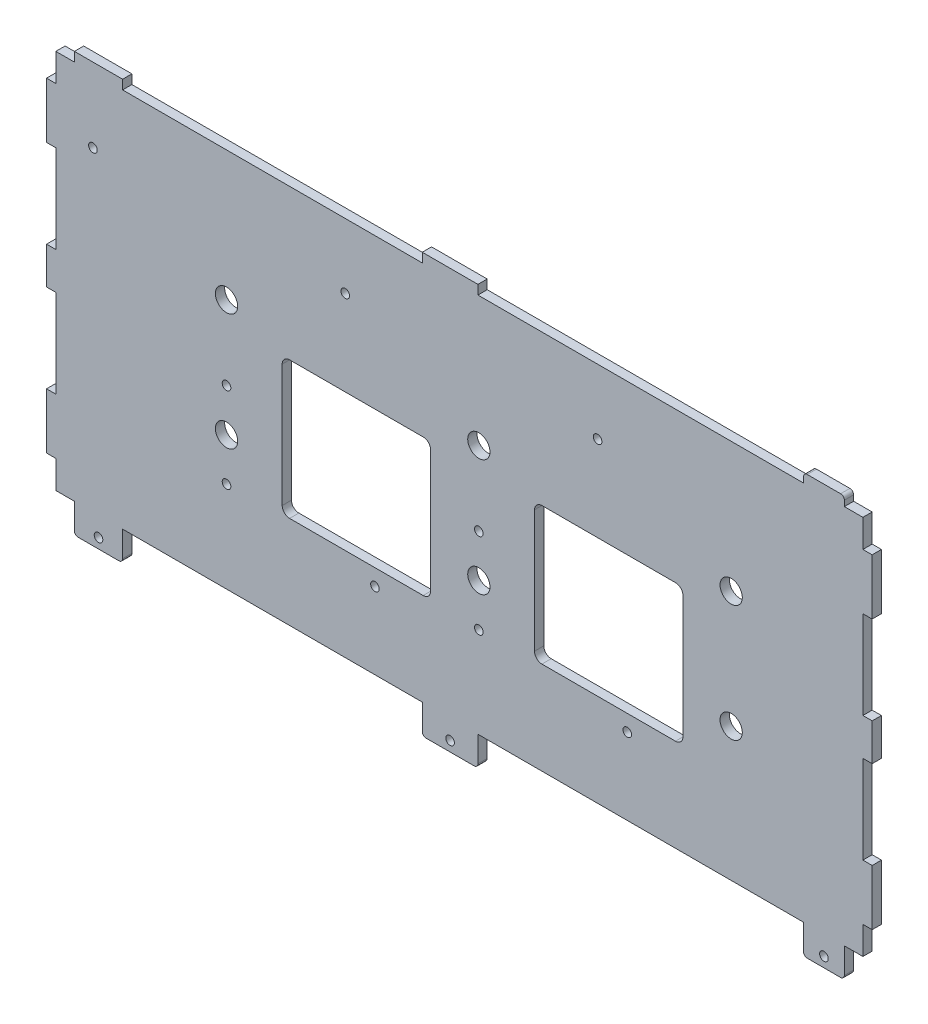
ISO-10303-21;
HEADER;
FILE_DESCRIPTION(('STEP AP214'),'2;1');
FILE_NAME('part.step','',(''),(''),'','','');
FILE_SCHEMA(('AUTOMOTIVE_DESIGN { 1 0 10303 214 1 1 1 1 }'));
ENDSEC;
DATA;
#1=APPLICATION_CONTEXT('core data for automotive mechanical design processes');
#2=APPLICATION_PROTOCOL_DEFINITION('international standard','automotive_design',2000,#1);
#3=PRODUCT_CONTEXT('',#1,'mechanical');
#4=PRODUCT('Part','Part','',(#3));
#5=PRODUCT_RELATED_PRODUCT_CATEGORY('part','',(#4));
#6=PRODUCT_DEFINITION_FORMATION('','',#4);
#7=PRODUCT_DEFINITION_CONTEXT('part definition',#1,'design');
#8=PRODUCT_DEFINITION('design','',#6,#7);
#9=PRODUCT_DEFINITION_SHAPE('','',#8);
#10=(LENGTH_UNIT() NAMED_UNIT(*) SI_UNIT(.MILLI.,.METRE.));
#11=(NAMED_UNIT(*) PLANE_ANGLE_UNIT() SI_UNIT($,.RADIAN.));
#12=(NAMED_UNIT(*) SI_UNIT($,.STERADIAN.) SOLID_ANGLE_UNIT());
#13=UNCERTAINTY_MEASURE_WITH_UNIT(LENGTH_MEASURE(1.E-05),#10,'distance_accuracy_value','');
#14=(GEOMETRIC_REPRESENTATION_CONTEXT(3) GLOBAL_UNCERTAINTY_ASSIGNED_CONTEXT((#13)) GLOBAL_UNIT_ASSIGNED_CONTEXT((#10,
#11,#12)) REPRESENTATION_CONTEXT('',''));
#15=CARTESIAN_POINT('',(0.,0.,0.));
#16=DIRECTION('',(0.,0.,1.));
#17=DIRECTION('',(1.,0.,0.));
#18=AXIS2_PLACEMENT_3D('',#15,#16,#17);
#19=CARTESIAN_POINT('',(0.,0.,3.175));
#20=DIRECTION('',(0.,0.,-1.));
#21=DIRECTION('',(-1.,0.,0.));
#22=AXIS2_PLACEMENT_3D('',#19,#20,#21);
#23=PLANE('',#22);
#24=CARTESIAN_POINT('',(12.7,107.95,3.175));
#25=DIRECTION('',(0.,0.,1.));
#26=DIRECTION('',(1.,0.,0.));
#27=AXIS2_PLACEMENT_3D('',#24,#25,#26);
#28=CIRCLE('',#27,1.47319999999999);
#29=CARTESIAN_POINT('',(14.1732,107.95,3.175));
#30=VERTEX_POINT('',#29);
#31=EDGE_CURVE('E1210',#30,#30,#28,.T.);
#32=ORIENTED_EDGE('',*,*,#31,.F.);
#33=EDGE_LOOP('',(#32));
#34=FACE_BOUND('',#33,.T.);
#35=CARTESIAN_POINT('',(109.22,26.162,3.175));
#36=DIRECTION('',(0.,0.,1.));
#37=DIRECTION('',(1.,0.,0.));
#38=AXIS2_PLACEMENT_3D('',#35,#36,#37);
#39=CIRCLE('',#38,1.47319999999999);
#40=CARTESIAN_POINT('',(110.6932,26.162,3.175));
#41=VERTEX_POINT('',#40);
#42=EDGE_CURVE('E1206',#41,#41,#39,.T.);
#43=ORIENTED_EDGE('',*,*,#42,.F.);
#44=EDGE_LOOP('',(#43));
#45=FACE_BOUND('',#44,.T.);
#46=CARTESIAN_POINT('',(262.89,-6.604,3.175));
#47=DIRECTION('',(0.,0.,1.));
#48=DIRECTION('',(1.,0.,0.));
#49=AXIS2_PLACEMENT_3D('',#46,#47,#48);
#50=CIRCLE('',#49,1.47320000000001);
#51=CARTESIAN_POINT('',(264.3632,-6.604,3.175));
#52=VERTEX_POINT('',#51);
#53=EDGE_CURVE('E1191',#52,#52,#50,.T.);
#54=ORIENTED_EDGE('',*,*,#53,.F.);
#55=EDGE_LOOP('',(#54));
#56=FACE_BOUND('',#55,.T.);
#57=CARTESIAN_POINT('',(58.42,31.115,3.175));
#58=DIRECTION('',(0.,0.,1.));
#59=DIRECTION('',(1.,0.,0.));
#60=AXIS2_PLACEMENT_3D('',#57,#58,#59);
#61=CIRCLE('',#60,1.47319999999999);
#62=CARTESIAN_POINT('',(59.8932,31.115,3.175));
#63=VERTEX_POINT('',#62);
#64=EDGE_CURVE('E1186',#63,#63,#61,.T.);
#65=ORIENTED_EDGE('',*,*,#64,.F.);
#66=EDGE_LOOP('',(#65));
#67=FACE_BOUND('',#66,.T.);
#68=CARTESIAN_POINT('',(144.78,31.115,3.175));
#69=DIRECTION('',(0.,0.,1.));
#70=DIRECTION('',(1.,0.,0.));
#71=AXIS2_PLACEMENT_3D('',#68,#69,#70);
#72=CIRCLE('',#71,1.47319999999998);
#73=CARTESIAN_POINT('',(146.2532,31.115,3.175));
#74=VERTEX_POINT('',#73);
#75=EDGE_CURVE('E1178',#74,#74,#72,.T.);
#76=ORIENTED_EDGE('',*,*,#75,.F.);
#77=EDGE_LOOP('',(#76));
#78=FACE_BOUND('',#77,.T.);
#79=CARTESIAN_POINT('',(231.14,45.72,3.175));
#80=DIRECTION('',(0.,0.,1.));
#81=DIRECTION('',(1.,0.,0.));
#82=AXIS2_PLACEMENT_3D('',#79,#80,#81);
#83=CIRCLE('',#82,3.80999999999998);
#84=CARTESIAN_POINT('',(234.95,45.72,3.175));
#85=VERTEX_POINT('',#84);
#86=EDGE_CURVE('E1577',#85,#85,#83,.T.);
#87=ORIENTED_EDGE('',*,*,#86,.F.);
#88=EDGE_LOOP('',(#87));
#89=FACE_BOUND('',#88,.T.);
#90=CARTESIAN_POINT('',(144.78,85.725,3.175));
#91=DIRECTION('',(0.,0.,1.));
#92=DIRECTION('',(-1.,0.,0.));
#93=AXIS2_PLACEMENT_3D('',#90,#91,#92);
#94=CIRCLE('',#93,3.81000000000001);
#95=CARTESIAN_POINT('',(140.97,85.725,3.175));
#96=VERTEX_POINT('',#95);
#97=EDGE_CURVE('E1555',#96,#96,#94,.T.);
#98=ORIENTED_EDGE('',*,*,#97,.F.);
#99=EDGE_LOOP('',(#98));
#100=FACE_BOUND('',#99,.T.);
#101=CARTESIAN_POINT('',(58.42,45.72,3.175));
#102=DIRECTION('',(0.,0.,1.));
#103=DIRECTION('',(1.,0.,0.));
#104=AXIS2_PLACEMENT_3D('',#101,#102,#103);
#105=CIRCLE('',#104,3.81);
#106=CARTESIAN_POINT('',(62.23,45.72,3.175));
#107=VERTEX_POINT('',#106);
#108=EDGE_CURVE('E1533',#107,#107,#105,.T.);
#109=ORIENTED_EDGE('',*,*,#108,.F.);
#110=EDGE_LOOP('',(#109));
#111=FACE_BOUND('',#110,.T.);
#112=CARTESIAN_POINT('',(231.14,85.725,3.175));
#113=DIRECTION('',(0.,0.,1.));
#114=DIRECTION('',(1.,0.,0.));
#115=AXIS2_PLACEMENT_3D('',#112,#113,#114);
#116=CIRCLE('',#115,3.80999999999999);
#117=CARTESIAN_POINT('',(234.95,85.725,3.175));
#118=VERTEX_POINT('',#117);
#119=EDGE_CURVE('E670',#118,#118,#116,.T.);
#120=ORIENTED_EDGE('',*,*,#119,.F.);
#121=EDGE_LOOP('',(#120));
#122=FACE_BOUND('',#121,.T.);
#123=DIRECTION('',(-1.,0.,0.));
#124=VECTOR('',#123,1.);
#125=CARTESIAN_POINT('',(255.905,133.35,3.175));
#126=LINE('',#125,#124);
#127=CARTESIAN_POINT('',(268.605,133.35,3.175));
#128=VERTEX_POINT('',#127);
#129=CARTESIAN_POINT('',(257.175,133.35,3.175));
#130=VERTEX_POINT('',#129);
#131=EDGE_CURVE('E544',#128,#130,#126,.T.);
#132=ORIENTED_EDGE('',*,*,#131,.T.);
#133=CARTESIAN_POINT('',(257.175,132.08,3.175));
#134=DIRECTION('',(0.,0.,-1.));
#135=DIRECTION('',(-1.,0.,0.));
#136=AXIS2_PLACEMENT_3D('',#133,#134,#135);
#137=CIRCLE('',#136,1.27);
#138=CARTESIAN_POINT('',(255.905,132.08,3.175));
#139=VERTEX_POINT('',#138);
#140=EDGE_CURVE('E823',#130,#139,#137,.F.);
#141=ORIENTED_EDGE('',*,*,#140,.T.);
#142=DIRECTION('',(0.,-1.,0.));
#143=VECTOR('',#142,1.);
#144=CARTESIAN_POINT('',(255.905,133.35,3.175));
#145=LINE('',#144,#143);
#146=CARTESIAN_POINT('',(255.905,130.175,3.175));
#147=VERTEX_POINT('',#146);
#148=EDGE_CURVE('E1249',#139,#147,#145,.T.);
#149=ORIENTED_EDGE('',*,*,#148,.T.);
#150=DIRECTION('',(-1.,0.,0.));
#151=VECTOR('',#150,1.);
#152=CARTESIAN_POINT('',(0.,130.175,3.175));
#153=LINE('',#152,#151);
#154=CARTESIAN_POINT('',(144.4625,130.175,3.175));
#155=VERTEX_POINT('',#154);
#156=EDGE_CURVE('E537',#147,#155,#153,.T.);
#157=ORIENTED_EDGE('',*,*,#156,.T.);
#158=DIRECTION('',(0.,1.,0.));
#159=VECTOR('',#158,1.);
#160=CARTESIAN_POINT('',(144.4625,133.35,3.175));
#161=LINE('',#160,#159);
#162=CARTESIAN_POINT('',(144.4625,133.35,3.175));
#163=VERTEX_POINT('',#162);
#164=EDGE_CURVE('E551',#155,#163,#161,.T.);
#165=ORIENTED_EDGE('',*,*,#164,.T.);
#166=DIRECTION('',(-1.,0.,0.));
#167=VECTOR('',#166,1.);
#168=CARTESIAN_POINT('',(125.4125,133.35,3.175));
#169=LINE('',#168,#167);
#170=CARTESIAN_POINT('',(125.4125,133.35,3.175));
#171=VERTEX_POINT('',#170);
#172=EDGE_CURVE('E554',#163,#171,#169,.T.);
#173=ORIENTED_EDGE('',*,*,#172,.T.);
#174=DIRECTION('',(0.,-1.,0.));
#175=VECTOR('',#174,1.);
#176=CARTESIAN_POINT('',(125.4125,133.35,3.175));
#177=LINE('',#176,#175);
#178=CARTESIAN_POINT('',(125.4125,130.175,3.175));
#179=VERTEX_POINT('',#178);
#180=EDGE_CURVE('E548',#171,#179,#177,.T.);
#181=ORIENTED_EDGE('',*,*,#180,.T.);
#182=CARTESIAN_POINT('',(22.86,130.175,3.175));
#183=VERTEX_POINT('',#182);
#184=EDGE_CURVE('E604',#179,#183,#153,.T.);
#185=ORIENTED_EDGE('',*,*,#184,.T.);
#186=DIRECTION('',(0.,1.,0.));
#187=VECTOR('',#186,1.);
#188=CARTESIAN_POINT('',(22.86,130.175,3.175));
#189=LINE('',#188,#187);
#190=CARTESIAN_POINT('',(22.86,133.35,3.175));
#191=VERTEX_POINT('',#190);
#192=EDGE_CURVE('E573',#183,#191,#189,.T.);
#193=ORIENTED_EDGE('',*,*,#192,.T.);
#194=DIRECTION('',(-1.,0.,0.));
#195=VECTOR('',#194,1.);
#196=CARTESIAN_POINT('',(6.35,133.35,3.175));
#197=LINE('',#196,#195);
#198=CARTESIAN_POINT('',(6.35,133.35,3.175));
#199=VERTEX_POINT('',#198);
#200=EDGE_CURVE('E570',#191,#199,#197,.T.);
#201=ORIENTED_EDGE('',*,*,#200,.T.);
#202=DIRECTION('',(0.,-1.,0.));
#203=VECTOR('',#202,1.);
#204=CARTESIAN_POINT('',(6.35000000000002,130.175,3.175));
#205=LINE('',#204,#203);
#206=CARTESIAN_POINT('',(6.35000000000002,130.175,3.175));
#207=VERTEX_POINT('',#206);
#208=EDGE_CURVE('E576',#199,#207,#205,.T.);
#209=ORIENTED_EDGE('',*,*,#208,.T.);
#210=CARTESIAN_POINT('',(0.,130.175,3.175));
#211=VERTEX_POINT('',#210);
#212=EDGE_CURVE('E1004',#207,#211,#153,.T.);
#213=ORIENTED_EDGE('',*,*,#212,.T.);
#214=DIRECTION('',(0.,-1.,0.));
#215=VECTOR('',#214,1.);
#216=CARTESIAN_POINT('',(0.,0.,3.175));
#217=LINE('',#216,#215);
#218=CARTESIAN_POINT('',(0.,120.65,3.175));
#219=VERTEX_POINT('',#218);
#220=EDGE_CURVE('E625',#211,#219,#217,.T.);
#221=ORIENTED_EDGE('',*,*,#220,.T.);
#222=DIRECTION('',(-1.,0.,0.));
#223=VECTOR('',#222,1.);
#224=CARTESIAN_POINT('',(0.,120.65,3.175));
#225=LINE('',#224,#223);
#226=CARTESIAN_POINT('',(-3.17499999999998,120.65,3.175));
#227=VERTEX_POINT('',#226);
#228=EDGE_CURVE('E755',#219,#227,#225,.T.);
#229=ORIENTED_EDGE('',*,*,#228,.T.);
#230=DIRECTION('',(0.,-1.,0.));
#231=VECTOR('',#230,1.);
#232=CARTESIAN_POINT('',(-3.17499999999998,120.65,3.175));
#233=LINE('',#232,#231);
#234=CARTESIAN_POINT('',(-3.17499999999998,101.6,3.175));
#235=VERTEX_POINT('',#234);
#236=EDGE_CURVE('E764',#227,#235,#233,.T.);
#237=ORIENTED_EDGE('',*,*,#236,.T.);
#238=DIRECTION('',(1.,0.,0.));
#239=VECTOR('',#238,1.);
#240=CARTESIAN_POINT('',(0.,101.6,3.175));
#241=LINE('',#240,#239);
#242=CARTESIAN_POINT('',(0.,101.6,3.175));
#243=VERTEX_POINT('',#242);
#244=EDGE_CURVE('E751',#235,#243,#241,.T.);
#245=ORIENTED_EDGE('',*,*,#244,.T.);
#246=CARTESIAN_POINT('',(0.,71.4375,3.175));
#247=VERTEX_POINT('',#246);
#248=EDGE_CURVE('E661',#243,#247,#217,.T.);
#249=ORIENTED_EDGE('',*,*,#248,.T.);
#250=DIRECTION('',(-1.,0.,0.));
#251=VECTOR('',#250,1.);
#252=CARTESIAN_POINT('',(0.,71.4375,3.175));
#253=LINE('',#252,#251);
#254=CARTESIAN_POINT('',(-3.17499999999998,71.4375,3.175));
#255=VERTEX_POINT('',#254);
#256=EDGE_CURVE('E681',#247,#255,#253,.T.);
#257=ORIENTED_EDGE('',*,*,#256,.T.);
#258=DIRECTION('',(0.,-1.,0.));
#259=VECTOR('',#258,1.);
#260=CARTESIAN_POINT('',(-3.17499999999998,71.4375,3.175));
#261=LINE('',#260,#259);
#262=CARTESIAN_POINT('',(-3.17499999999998,58.7375,3.175));
#263=VERTEX_POINT('',#262);
#264=EDGE_CURVE('E684',#255,#263,#261,.T.);
#265=ORIENTED_EDGE('',*,*,#264,.T.);
#266=DIRECTION('',(1.,0.,0.));
#267=VECTOR('',#266,1.);
#268=CARTESIAN_POINT('',(0.,58.7375,3.175));
#269=LINE('',#268,#267);
#270=CARTESIAN_POINT('',(0.,58.7375,3.175));
#271=VERTEX_POINT('',#270);
#272=EDGE_CURVE('E691',#263,#271,#269,.T.);
#273=ORIENTED_EDGE('',*,*,#272,.T.);
#274=CARTESIAN_POINT('',(0.,28.5749999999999,3.175));
#275=VERTEX_POINT('',#274);
#276=EDGE_CURVE('E663',#271,#275,#217,.T.);
#277=ORIENTED_EDGE('',*,*,#276,.T.);
#278=DIRECTION('',(-1.,0.,0.));
#279=VECTOR('',#278,1.);
#280=CARTESIAN_POINT('',(0.,28.5749999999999,3.175));
#281=LINE('',#280,#279);
#282=CARTESIAN_POINT('',(-3.17499999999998,28.5749999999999,3.175));
#283=VERTEX_POINT('',#282);
#284=EDGE_CURVE('E736',#275,#283,#281,.T.);
#285=ORIENTED_EDGE('',*,*,#284,.T.);
#286=DIRECTION('',(0.,-1.,0.));
#287=VECTOR('',#286,1.);
#288=CARTESIAN_POINT('',(-3.17499999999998,9.52499999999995,3.175));
#289=LINE('',#288,#287);
#290=CARTESIAN_POINT('',(-3.17499999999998,9.52499999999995,3.175));
#291=VERTEX_POINT('',#290);
#292=EDGE_CURVE('E725',#283,#291,#289,.T.);
#293=ORIENTED_EDGE('',*,*,#292,.T.);
#294=DIRECTION('',(1.,0.,0.));
#295=VECTOR('',#294,1.);
#296=CARTESIAN_POINT('',(0.,9.52499999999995,3.175));
#297=LINE('',#296,#295);
#298=CARTESIAN_POINT('',(0.,9.52499999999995,3.175));
#299=VERTEX_POINT('',#298);
#300=EDGE_CURVE('E728',#291,#299,#297,.T.);
#301=ORIENTED_EDGE('',*,*,#300,.T.);
#302=CARTESIAN_POINT('',(0.,0.,3.175));
#303=VERTEX_POINT('',#302);
#304=EDGE_CURVE('E620',#299,#303,#217,.T.);
#305=ORIENTED_EDGE('',*,*,#304,.T.);
#306=DIRECTION('',(1.,0.,0.));
#307=VECTOR('',#306,1.);
#308=CARTESIAN_POINT('',(0.,0.,3.175));
#309=LINE('',#308,#307);
#310=CARTESIAN_POINT('',(6.35000000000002,0.,3.175));
#311=VERTEX_POINT('',#310);
#312=EDGE_CURVE('E641',#303,#311,#309,.T.);
#313=ORIENTED_EDGE('',*,*,#312,.T.);
#314=DIRECTION('',(0.,-1.,0.));
#315=VECTOR('',#314,1.);
#316=CARTESIAN_POINT('',(6.35000000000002,0.,3.175));
#317=LINE('',#316,#315);
#318=CARTESIAN_POINT('',(6.35000000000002,-8.76299999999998,3.175));
#319=VERTEX_POINT('',#318);
#320=EDGE_CURVE('E783',#311,#319,#317,.T.);
#321=ORIENTED_EDGE('',*,*,#320,.T.);
#322=CARTESIAN_POINT('',(7.62000000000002,-8.76299999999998,3.175));
#323=DIRECTION('',(0.,0.,-1.));
#324=DIRECTION('',(-1.,0.,0.));
#325=AXIS2_PLACEMENT_3D('',#322,#323,#324);
#326=CIRCLE('',#325,1.27);
#327=CARTESIAN_POINT('',(7.62000000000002,-10.033,3.175));
#328=VERTEX_POINT('',#327);
#329=EDGE_CURVE('E807',#319,#328,#326,.F.);
#330=ORIENTED_EDGE('',*,*,#329,.T.);
#331=DIRECTION('',(1.,0.,0.));
#332=VECTOR('',#331,1.);
#333=CARTESIAN_POINT('',(6.35000000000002,-10.033,3.175));
#334=LINE('',#333,#332);
#335=CARTESIAN_POINT('',(21.59,-10.033,3.175));
#336=VERTEX_POINT('',#335);
#337=EDGE_CURVE('E810',#328,#336,#334,.T.);
#338=ORIENTED_EDGE('',*,*,#337,.T.);
#339=CARTESIAN_POINT('',(21.59,-8.76299999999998,3.175));
#340=DIRECTION('',(0.,0.,-1.));
#341=DIRECTION('',(-1.,0.,0.));
#342=AXIS2_PLACEMENT_3D('',#339,#340,#341);
#343=CIRCLE('',#342,1.27);
#344=CARTESIAN_POINT('',(22.86,-8.76299999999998,3.175));
#345=VERTEX_POINT('',#344);
#346=EDGE_CURVE('E812',#336,#345,#343,.F.);
#347=ORIENTED_EDGE('',*,*,#346,.T.);
#348=DIRECTION('',(0.,1.,0.));
#349=VECTOR('',#348,1.);
#350=CARTESIAN_POINT('',(22.86,0.,3.175));
#351=LINE('',#350,#349);
#352=CARTESIAN_POINT('',(22.86,0.,3.175));
#353=VERTEX_POINT('',#352);
#354=EDGE_CURVE('E808',#345,#353,#351,.T.);
#355=ORIENTED_EDGE('',*,*,#354,.T.);
#356=CARTESIAN_POINT('',(125.4125,0.,3.175));
#357=VERTEX_POINT('',#356);
#358=EDGE_CURVE('E637',#353,#357,#309,.T.);
#359=ORIENTED_EDGE('',*,*,#358,.T.);
#360=DIRECTION('',(0.,-1.,0.));
#361=VECTOR('',#360,1.);
#362=CARTESIAN_POINT('',(125.4125,0.,3.175));
#363=LINE('',#362,#361);
#364=CARTESIAN_POINT('',(125.4125,-8.76299999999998,3.175));
#365=VERTEX_POINT('',#364);
#366=EDGE_CURVE('E888',#357,#365,#363,.T.);
#367=ORIENTED_EDGE('',*,*,#366,.T.);
#368=CARTESIAN_POINT('',(126.6825,-8.76299999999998,3.175));
#369=DIRECTION('',(0.,0.,-1.));
#370=DIRECTION('',(-1.,0.,0.));
#371=AXIS2_PLACEMENT_3D('',#368,#369,#370);
#372=CIRCLE('',#371,1.27);
#373=CARTESIAN_POINT('',(126.6825,-10.033,3.175));
#374=VERTEX_POINT('',#373);
#375=EDGE_CURVE('E814',#365,#374,#372,.F.);
#376=ORIENTED_EDGE('',*,*,#375,.T.);
#377=DIRECTION('',(1.,0.,0.));
#378=VECTOR('',#377,1.);
#379=CARTESIAN_POINT('',(125.4125,-10.033,3.175));
#380=LINE('',#379,#378);
#381=CARTESIAN_POINT('',(143.1925,-10.033,3.175));
#382=VERTEX_POINT('',#381);
#383=EDGE_CURVE('E895',#374,#382,#380,.T.);
#384=ORIENTED_EDGE('',*,*,#383,.T.);
#385=CARTESIAN_POINT('',(143.1925,-8.76299999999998,3.175));
#386=DIRECTION('',(0.,0.,-1.));
#387=DIRECTION('',(-1.,0.,0.));
#388=AXIS2_PLACEMENT_3D('',#385,#386,#387);
#389=CIRCLE('',#388,1.27);
#390=CARTESIAN_POINT('',(144.4625,-8.76299999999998,3.175));
#391=VERTEX_POINT('',#390);
#392=EDGE_CURVE('E816',#382,#391,#389,.F.);
#393=ORIENTED_EDGE('',*,*,#392,.T.);
#394=DIRECTION('',(0.,1.,0.));
#395=VECTOR('',#394,1.);
#396=CARTESIAN_POINT('',(144.4625,0.,3.175));
#397=LINE('',#396,#395);
#398=CARTESIAN_POINT('',(144.4625,0.,3.175));
#399=VERTEX_POINT('',#398);
#400=EDGE_CURVE('E890',#391,#399,#397,.T.);
#401=ORIENTED_EDGE('',*,*,#400,.T.);
#402=CARTESIAN_POINT('',(255.905,0.,3.175));
#403=VERTEX_POINT('',#402);
#404=EDGE_CURVE('E624',#399,#403,#309,.T.);
#405=ORIENTED_EDGE('',*,*,#404,.T.);
#406=DIRECTION('',(0.,-1.,0.));
#407=VECTOR('',#406,1.);
#408=CARTESIAN_POINT('',(255.905,0.,3.175));
#409=LINE('',#408,#407);
#410=CARTESIAN_POINT('',(255.905,-8.76299999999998,3.175));
#411=VERTEX_POINT('',#410);
#412=EDGE_CURVE('E1396',#403,#411,#409,.T.);
#413=ORIENTED_EDGE('',*,*,#412,.T.);
#414=CARTESIAN_POINT('',(257.175,-8.76299999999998,3.175));
#415=DIRECTION('',(0.,0.,-1.));
#416=DIRECTION('',(-1.,0.,0.));
#417=AXIS2_PLACEMENT_3D('',#414,#415,#416);
#418=CIRCLE('',#417,1.27);
#419=CARTESIAN_POINT('',(257.175,-10.033,3.175));
#420=VERTEX_POINT('',#419);
#421=EDGE_CURVE('E818',#411,#420,#418,.F.);
#422=ORIENTED_EDGE('',*,*,#421,.T.);
#423=DIRECTION('',(1.,0.,0.));
#424=VECTOR('',#423,1.);
#425=CARTESIAN_POINT('',(255.905,-10.033,3.175));
#426=LINE('',#425,#424);
#427=CARTESIAN_POINT('',(268.605,-10.033,3.175));
#428=VERTEX_POINT('',#427);
#429=EDGE_CURVE('E1404',#420,#428,#426,.T.);
#430=ORIENTED_EDGE('',*,*,#429,.T.);
#431=CARTESIAN_POINT('',(268.605,-8.76299999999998,3.175));
#432=DIRECTION('',(0.,0.,-1.));
#433=DIRECTION('',(-1.,0.,0.));
#434=AXIS2_PLACEMENT_3D('',#431,#432,#433);
#435=CIRCLE('',#434,1.27);
#436=CARTESIAN_POINT('',(269.875,-8.76299999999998,3.175));
#437=VERTEX_POINT('',#436);
#438=EDGE_CURVE('E58',#428,#437,#435,.F.);
#439=ORIENTED_EDGE('',*,*,#438,.T.);
#440=DIRECTION('',(0.,1.,0.));
#441=VECTOR('',#440,1.);
#442=CARTESIAN_POINT('',(269.875,0.,3.175));
#443=LINE('',#442,#441);
#444=CARTESIAN_POINT('',(269.875,0.,3.175));
#445=VERTEX_POINT('',#444);
#446=EDGE_CURVE('E1393',#437,#445,#443,.T.);
#447=ORIENTED_EDGE('',*,*,#446,.T.);
#448=CARTESIAN_POINT('',(276.225,0.,3.175));
#449=VERTEX_POINT('',#448);
#450=EDGE_CURVE('E621',#445,#449,#309,.T.);
#451=ORIENTED_EDGE('',*,*,#450,.T.);
#452=DIRECTION('',(0.,1.,0.));
#453=VECTOR('',#452,1.);
#454=CARTESIAN_POINT('',(276.225,0.,3.175));
#455=LINE('',#454,#453);
#456=CARTESIAN_POINT('',(276.225,9.52500000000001,3.175));
#457=VERTEX_POINT('',#456);
#458=EDGE_CURVE('E1001',#449,#457,#455,.T.);
#459=ORIENTED_EDGE('',*,*,#458,.T.);
#460=DIRECTION('',(1.,0.,0.));
#461=VECTOR('',#460,1.);
#462=CARTESIAN_POINT('',(276.225,9.52500000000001,3.175));
#463=LINE('',#462,#461);
#464=CARTESIAN_POINT('',(279.4,9.52500000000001,3.175));
#465=VERTEX_POINT('',#464);
#466=EDGE_CURVE('E1112',#457,#465,#463,.T.);
#467=ORIENTED_EDGE('',*,*,#466,.T.);
#468=DIRECTION('',(0.,1.,0.));
#469=VECTOR('',#468,1.);
#470=CARTESIAN_POINT('',(279.4,9.52500000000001,3.175));
#471=LINE('',#470,#469);
#472=CARTESIAN_POINT('',(279.4,28.575,3.175));
#473=VERTEX_POINT('',#472);
#474=EDGE_CURVE('E1114',#465,#473,#471,.T.);
#475=ORIENTED_EDGE('',*,*,#474,.T.);
#476=DIRECTION('',(-1.,0.,0.));
#477=VECTOR('',#476,1.);
#478=CARTESIAN_POINT('',(276.225,28.575,3.175));
#479=LINE('',#478,#477);
#480=CARTESIAN_POINT('',(276.225,28.575,3.175));
#481=VERTEX_POINT('',#480);
#482=EDGE_CURVE('E1117',#473,#481,#479,.T.);
#483=ORIENTED_EDGE('',*,*,#482,.T.);
#484=CARTESIAN_POINT('',(276.225,58.7375,3.175));
#485=VERTEX_POINT('',#484);
#486=EDGE_CURVE('E1005',#481,#485,#455,.T.);
#487=ORIENTED_EDGE('',*,*,#486,.T.);
#488=DIRECTION('',(1.,0.,0.));
#489=VECTOR('',#488,1.);
#490=CARTESIAN_POINT('',(276.225,58.7375,3.175));
#491=LINE('',#490,#489);
#492=CARTESIAN_POINT('',(279.4,58.7375,3.175));
#493=VERTEX_POINT('',#492);
#494=EDGE_CURVE('E1088',#485,#493,#491,.T.);
#495=ORIENTED_EDGE('',*,*,#494,.T.);
#496=DIRECTION('',(0.,1.,0.));
#497=VECTOR('',#496,1.);
#498=CARTESIAN_POINT('',(279.4,71.4375,3.175));
#499=LINE('',#498,#497);
#500=CARTESIAN_POINT('',(279.4,71.4375,3.175));
#501=VERTEX_POINT('',#500);
#502=EDGE_CURVE('E1090',#493,#501,#499,.T.);
#503=ORIENTED_EDGE('',*,*,#502,.T.);
#504=DIRECTION('',(-1.,0.,0.));
#505=VECTOR('',#504,1.);
#506=CARTESIAN_POINT('',(276.225,71.4375,3.175));
#507=LINE('',#506,#505);
#508=CARTESIAN_POINT('',(276.225,71.4375,3.175));
#509=VERTEX_POINT('',#508);
#510=EDGE_CURVE('E1093',#501,#509,#507,.T.);
#511=ORIENTED_EDGE('',*,*,#510,.T.);
#512=CARTESIAN_POINT('',(276.225,101.6,3.175));
#513=VERTEX_POINT('',#512);
#514=EDGE_CURVE('E1008',#509,#513,#455,.T.);
#515=ORIENTED_EDGE('',*,*,#514,.T.);
#516=DIRECTION('',(1.,0.,0.));
#517=VECTOR('',#516,1.);
#518=CARTESIAN_POINT('',(276.225,101.6,3.175));
#519=LINE('',#518,#517);
#520=CARTESIAN_POINT('',(279.4,101.6,3.175));
#521=VERTEX_POINT('',#520);
#522=EDGE_CURVE('E1136',#513,#521,#519,.T.);
#523=ORIENTED_EDGE('',*,*,#522,.T.);
#524=DIRECTION('',(0.,1.,0.));
#525=VECTOR('',#524,1.);
#526=CARTESIAN_POINT('',(279.4,120.65,3.175));
#527=LINE('',#526,#525);
#528=CARTESIAN_POINT('',(279.4,120.65,3.175));
#529=VERTEX_POINT('',#528);
#530=EDGE_CURVE('E1135',#521,#529,#527,.T.);
#531=ORIENTED_EDGE('',*,*,#530,.T.);
#532=DIRECTION('',(-1.,0.,0.));
#533=VECTOR('',#532,1.);
#534=CARTESIAN_POINT('',(276.225,120.65,3.175));
#535=LINE('',#534,#533);
#536=CARTESIAN_POINT('',(276.225,120.65,3.175));
#537=VERTEX_POINT('',#536);
#538=EDGE_CURVE('E1014',#529,#537,#535,.T.);
#539=ORIENTED_EDGE('',*,*,#538,.T.);
#540=CARTESIAN_POINT('',(276.225,130.175,3.175));
#541=VERTEX_POINT('',#540);
#542=EDGE_CURVE('E1006',#537,#541,#455,.T.);
#543=ORIENTED_EDGE('',*,*,#542,.T.);
#544=CARTESIAN_POINT('',(269.875,130.175,3.175));
#545=VERTEX_POINT('',#544);
#546=EDGE_CURVE('E1166',#541,#545,#153,.T.);
#547=ORIENTED_EDGE('',*,*,#546,.T.);
#548=DIRECTION('',(0.,1.,0.));
#549=VECTOR('',#548,1.);
#550=CARTESIAN_POINT('',(269.875,133.35,3.175));
#551=LINE('',#550,#549);
#552=CARTESIAN_POINT('',(269.875,132.08,3.175));
#553=VERTEX_POINT('',#552);
#554=EDGE_CURVE('E1251',#545,#553,#551,.T.);
#555=ORIENTED_EDGE('',*,*,#554,.T.);
#556=CARTESIAN_POINT('',(268.605,132.08,3.175));
#557=DIRECTION('',(0.,0.,-1.));
#558=DIRECTION('',(-1.,0.,0.));
#559=AXIS2_PLACEMENT_3D('',#556,#557,#558);
#560=CIRCLE('',#559,1.27);
#561=EDGE_CURVE('E821',#553,#128,#560,.F.);
#562=ORIENTED_EDGE('',*,*,#561,.T.);
#563=EDGE_LOOP('',(#132,#141,#149,#157,#165,#173,#181,#185,#193,#201,#209,#213,#221,#229,#237,
#245,#249,#257,#265,#273,#277,#285,#293,#301,#305,#313,#321,#330,#338,#347,#355,#359,#367,#376,
#384,#393,#401,#405,#413,#422,#430,#439,#447,#451,#459,#467,#475,#483,#487,#495,#503,#511,#515,
#523,#531,#539,#543,#547,#555,#562));
#564=FACE_BOUND('',#563,.T.);
#565=CARTESIAN_POINT('',(58.42,85.725,3.175));
#566=DIRECTION('',(0.,0.,1.));
#567=DIRECTION('',(1.,0.,0.));
#568=AXIS2_PLACEMENT_3D('',#565,#566,#567);
#569=CIRCLE('',#568,3.81);
#570=CARTESIAN_POINT('',(62.23,85.725,3.175));
#571=VERTEX_POINT('',#570);
#572=EDGE_CURVE('E1529',#571,#571,#569,.T.);
#573=ORIENTED_EDGE('',*,*,#572,.F.);
#574=EDGE_LOOP('',(#573));
#575=FACE_BOUND('',#574,.T.);
#576=CARTESIAN_POINT('',(144.78,45.72,3.175));
#577=DIRECTION('',(0.,0.,1.));
#578=DIRECTION('',(-1.,0.,0.));
#579=AXIS2_PLACEMENT_3D('',#576,#577,#578);
#580=CIRCLE('',#579,3.81000000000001);
#581=CARTESIAN_POINT('',(140.97,45.72,3.175));
#582=VERTEX_POINT('',#581);
#583=EDGE_CURVE('E1550',#582,#582,#580,.T.);
#584=ORIENTED_EDGE('',*,*,#583,.F.);
#585=EDGE_LOOP('',(#584));
#586=FACE_BOUND('',#585,.T.);
#587=DIRECTION('',(0.,1.,0.));
#588=VECTOR('',#587,1.);
#589=CARTESIAN_POINT('',(128.27,31.75,3.175));
#590=LINE('',#589,#588);
#591=CARTESIAN_POINT('',(128.27,34.29,3.175));
#592=VERTEX_POINT('',#591);
#593=CARTESIAN_POINT('',(128.27,76.2,3.175));
#594=VERTEX_POINT('',#593);
#595=EDGE_CURVE('E1567',#592,#594,#590,.T.);
#596=ORIENTED_EDGE('',*,*,#595,.F.);
#597=CARTESIAN_POINT('',(125.73,34.29,3.175));
#598=DIRECTION('',(0.,0.,-1.));
#599=DIRECTION('',(-1.,0.,0.));
#600=AXIS2_PLACEMENT_3D('',#597,#598,#599);
#601=CIRCLE('',#600,2.54);
#602=CARTESIAN_POINT('',(125.73,31.75,3.175));
#603=VERTEX_POINT('',#602);
#604=EDGE_CURVE('E986',#592,#603,#601,.T.);
#605=ORIENTED_EDGE('',*,*,#604,.T.);
#606=DIRECTION('',(1.,0.,0.));
#607=VECTOR('',#606,1.);
#608=CARTESIAN_POINT('',(77.47,31.75,3.175));
#609=LINE('',#608,#607);
#610=CARTESIAN_POINT('',(80.01,31.75,3.175));
#611=VERTEX_POINT('',#610);
#612=EDGE_CURVE('E1561',#611,#603,#609,.T.);
#613=ORIENTED_EDGE('',*,*,#612,.F.);
#614=CARTESIAN_POINT('',(80.01,34.29,3.175));
#615=DIRECTION('',(0.,0.,-1.));
#616=DIRECTION('',(-1.,0.,0.));
#617=AXIS2_PLACEMENT_3D('',#614,#615,#616);
#618=CIRCLE('',#617,2.54);
#619=CARTESIAN_POINT('',(77.47,34.29,3.175));
#620=VERTEX_POINT('',#619);
#621=EDGE_CURVE('E982',#611,#620,#618,.T.);
#622=ORIENTED_EDGE('',*,*,#621,.T.);
#623=DIRECTION('',(0.,-1.,0.));
#624=VECTOR('',#623,1.);
#625=CARTESIAN_POINT('',(77.47,31.75,3.175));
#626=LINE('',#625,#624);
#627=CARTESIAN_POINT('',(77.47,76.2,3.175));
#628=VERTEX_POINT('',#627);
#629=EDGE_CURVE('E1580',#628,#620,#626,.T.);
#630=ORIENTED_EDGE('',*,*,#629,.F.);
#631=CARTESIAN_POINT('',(80.01,76.2,3.175));
#632=DIRECTION('',(0.,0.,-1.));
#633=DIRECTION('',(-1.,0.,0.));
#634=AXIS2_PLACEMENT_3D('',#631,#632,#633);
#635=CIRCLE('',#634,2.54);
#636=CARTESIAN_POINT('',(80.01,78.74,3.175));
#637=VERTEX_POINT('',#636);
#638=EDGE_CURVE('E994',#628,#637,#635,.T.);
#639=ORIENTED_EDGE('',*,*,#638,.T.);
#640=DIRECTION('',(-1.,0.,0.));
#641=VECTOR('',#640,1.);
#642=CARTESIAN_POINT('',(77.47,78.74,3.175));
#643=LINE('',#642,#641);
#644=CARTESIAN_POINT('',(125.73,78.74,3.175));
#645=VERTEX_POINT('',#644);
#646=EDGE_CURVE('E1583',#645,#637,#643,.T.);
#647=ORIENTED_EDGE('',*,*,#646,.F.);
#648=CARTESIAN_POINT('',(125.73,76.2,3.175));
#649=DIRECTION('',(0.,0.,-1.));
#650=DIRECTION('',(-1.,0.,0.));
#651=AXIS2_PLACEMENT_3D('',#648,#649,#650);
#652=CIRCLE('',#651,2.54);
#653=EDGE_CURVE('E990',#645,#594,#652,.T.);
#654=ORIENTED_EDGE('',*,*,#653,.T.);
#655=EDGE_LOOP('',(#596,#605,#613,#622,#630,#639,#647,#654));
#656=FACE_BOUND('',#655,.T.);
#657=DIRECTION('',(0.,1.,0.));
#658=VECTOR('',#657,1.);
#659=CARTESIAN_POINT('',(214.63,31.75,3.175));
#660=LINE('',#659,#658);
#661=CARTESIAN_POINT('',(214.63,34.29,3.175));
#662=VERTEX_POINT('',#661);
#663=CARTESIAN_POINT('',(214.63,76.2,3.175));
#664=VERTEX_POINT('',#663);
#665=EDGE_CURVE('E1030',#662,#664,#660,.T.);
#666=ORIENTED_EDGE('',*,*,#665,.F.);
#667=CARTESIAN_POINT('',(212.09,34.29,3.175));
#668=DIRECTION('',(0.,0.,-1.));
#669=DIRECTION('',(-1.,0.,0.));
#670=AXIS2_PLACEMENT_3D('',#667,#668,#669);
#671=CIRCLE('',#670,2.54);
#672=CARTESIAN_POINT('',(212.09,31.75,3.175));
#673=VERTEX_POINT('',#672);
#674=EDGE_CURVE('E970',#662,#673,#671,.T.);
#675=ORIENTED_EDGE('',*,*,#674,.T.);
#676=DIRECTION('',(1.,0.,0.));
#677=VECTOR('',#676,1.);
#678=CARTESIAN_POINT('',(214.63,31.75,3.175));
#679=LINE('',#678,#677);
#680=CARTESIAN_POINT('',(166.37,31.75,3.175));
#681=VERTEX_POINT('',#680);
#682=EDGE_CURVE('E1591',#681,#673,#679,.T.);
#683=ORIENTED_EDGE('',*,*,#682,.F.);
#684=CARTESIAN_POINT('',(166.37,34.29,3.175));
#685=DIRECTION('',(0.,0.,-1.));
#686=DIRECTION('',(-1.,0.,0.));
#687=AXIS2_PLACEMENT_3D('',#684,#685,#686);
#688=CIRCLE('',#687,2.54);
#689=CARTESIAN_POINT('',(163.83,34.29,3.175));
#690=VERTEX_POINT('',#689);
#691=EDGE_CURVE('E966',#681,#690,#688,.T.);
#692=ORIENTED_EDGE('',*,*,#691,.T.);
#693=DIRECTION('',(0.,-1.,0.));
#694=VECTOR('',#693,1.);
#695=CARTESIAN_POINT('',(163.83,31.75,3.175));
#696=LINE('',#695,#694);
#697=CARTESIAN_POINT('',(163.83,76.2,3.175));
#698=VERTEX_POINT('',#697);
#699=EDGE_CURVE('E1607',#698,#690,#696,.T.);
#700=ORIENTED_EDGE('',*,*,#699,.F.);
#701=CARTESIAN_POINT('',(166.37,76.2,3.175));
#702=DIRECTION('',(0.,0.,-1.));
#703=DIRECTION('',(-1.,0.,0.));
#704=AXIS2_PLACEMENT_3D('',#701,#702,#703);
#705=CIRCLE('',#704,2.54);
#706=CARTESIAN_POINT('',(166.37,78.74,3.175));
#707=VERTEX_POINT('',#706);
#708=EDGE_CURVE('E978',#698,#707,#705,.T.);
#709=ORIENTED_EDGE('',*,*,#708,.T.);
#710=DIRECTION('',(-1.,0.,0.));
#711=VECTOR('',#710,1.);
#712=CARTESIAN_POINT('',(214.63,78.74,3.175));
#713=LINE('',#712,#711);
#714=CARTESIAN_POINT('',(212.09,78.74,3.175));
#715=VERTEX_POINT('',#714);
#716=EDGE_CURVE('E1609',#715,#707,#713,.T.);
#717=ORIENTED_EDGE('',*,*,#716,.F.);
#718=CARTESIAN_POINT('',(212.09,76.2,3.175));
#719=DIRECTION('',(0.,0.,-1.));
#720=DIRECTION('',(-1.,0.,0.));
#721=AXIS2_PLACEMENT_3D('',#718,#719,#720);
#722=CIRCLE('',#721,2.54);
#723=EDGE_CURVE('E974',#715,#664,#722,.T.);
#724=ORIENTED_EDGE('',*,*,#723,.T.);
#725=EDGE_LOOP('',(#666,#675,#683,#692,#700,#709,#717,#724));
#726=FACE_BOUND('',#725,.T.);
#727=CARTESIAN_POINT('',(144.78,60.325,3.175));
#728=DIRECTION('',(0.,0.,1.));
#729=DIRECTION('',(1.,0.,0.));
#730=AXIS2_PLACEMENT_3D('',#727,#728,#729);
#731=CIRCLE('',#730,1.47319999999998);
#732=CARTESIAN_POINT('',(146.2532,60.325,3.175));
#733=VERTEX_POINT('',#732);
#734=EDGE_CURVE('E1182',#733,#733,#731,.T.);
#735=ORIENTED_EDGE('',*,*,#734,.F.);
#736=EDGE_LOOP('',(#735));
#737=FACE_BOUND('',#736,.T.);
#738=CARTESIAN_POINT('',(58.42,60.325,3.175));
#739=DIRECTION('',(0.,0.,1.));
#740=DIRECTION('',(1.,0.,0.));
#741=AXIS2_PLACEMENT_3D('',#738,#739,#740);
#742=CIRCLE('',#741,1.47319999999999);
#743=CARTESIAN_POINT('',(59.8932,60.325,3.175));
#744=VERTEX_POINT('',#743);
#745=EDGE_CURVE('E1187',#744,#744,#742,.T.);
#746=ORIENTED_EDGE('',*,*,#745,.F.);
#747=EDGE_LOOP('',(#746));
#748=FACE_BOUND('',#747,.T.);
#749=CARTESIAN_POINT('',(14.605,-6.604,3.175));
#750=DIRECTION('',(0.,0.,1.));
#751=DIRECTION('',(1.,0.,0.));
#752=AXIS2_PLACEMENT_3D('',#749,#750,#751);
#753=CIRCLE('',#752,1.47319999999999);
#754=CARTESIAN_POINT('',(16.0782,-6.604,3.175));
#755=VERTEX_POINT('',#754);
#756=EDGE_CURVE('E1195',#755,#755,#753,.T.);
#757=ORIENTED_EDGE('',*,*,#756,.F.);
#758=EDGE_LOOP('',(#757));
#759=FACE_BOUND('',#758,.T.);
#760=CARTESIAN_POINT('',(134.9375,-6.604,3.175));
#761=DIRECTION('',(0.,0.,1.));
#762=DIRECTION('',(1.,0.,0.));
#763=AXIS2_PLACEMENT_3D('',#760,#761,#762);
#764=CIRCLE('',#763,1.47319999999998);
#765=CARTESIAN_POINT('',(136.4107,-6.604,3.175));
#766=VERTEX_POINT('',#765);
#767=EDGE_CURVE('E1199',#766,#766,#764,.T.);
#768=ORIENTED_EDGE('',*,*,#767,.F.);
#769=EDGE_LOOP('',(#768));
#770=FACE_BOUND('',#769,.T.);
#771=CARTESIAN_POINT('',(195.58,26.162,3.175));
#772=DIRECTION('',(0.,0.,1.));
#773=DIRECTION('',(1.,0.,0.));
#774=AXIS2_PLACEMENT_3D('',#771,#772,#773);
#775=CIRCLE('',#774,1.47319999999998);
#776=CARTESIAN_POINT('',(197.0532,26.162,3.175));
#777=VERTEX_POINT('',#776);
#778=EDGE_CURVE('E1203',#777,#777,#775,.T.);
#779=ORIENTED_EDGE('',*,*,#778,.F.);
#780=EDGE_LOOP('',(#779));
#781=FACE_BOUND('',#780,.T.);
#782=CARTESIAN_POINT('',(185.42,107.95,3.175));
#783=DIRECTION('',(0.,0.,1.));
#784=DIRECTION('',(1.,0.,0.));
#785=AXIS2_PLACEMENT_3D('',#782,#783,#784);
#786=CIRCLE('',#785,1.47319999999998);
#787=CARTESIAN_POINT('',(186.8932,107.95,3.175));
#788=VERTEX_POINT('',#787);
#789=EDGE_CURVE('E1209',#788,#788,#786,.T.);
#790=ORIENTED_EDGE('',*,*,#789,.F.);
#791=EDGE_LOOP('',(#790));
#792=FACE_BOUND('',#791,.T.);
#793=CARTESIAN_POINT('',(99.06,107.95,3.175));
#794=DIRECTION('',(0.,0.,1.));
#795=DIRECTION('',(1.,0.,0.));
#796=AXIS2_PLACEMENT_3D('',#793,#794,#795);
#797=CIRCLE('',#796,1.47319999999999);
#798=CARTESIAN_POINT('',(100.5332,107.95,3.175));
#799=VERTEX_POINT('',#798);
#800=EDGE_CURVE('E1222',#799,#799,#797,.T.);
#801=ORIENTED_EDGE('',*,*,#800,.F.);
#802=EDGE_LOOP('',(#801));
#803=FACE_BOUND('',#802,.T.);
#804=ADVANCED_FACE('F35',(#34,#45,#56,#67,#78,#89,#100,#111,#122,#564,#575,#586,#656,#726,#737,
#748,#759,#770,#781,#792,#803),#23,.F.);
#805=CARTESIAN_POINT('',(0.,130.175,3.175));
#806=DIRECTION('',(0.,-1.,0.));
#807=DIRECTION('',(0.,0.,-1.));
#808=AXIS2_PLACEMENT_3D('',#805,#806,#807);
#809=PLANE('',#808);
#810=DIRECTION('',(0.,0.,-1.));
#811=VECTOR('',#810,1.);
#812=CARTESIAN_POINT('',(255.905,130.175,3.175));
#813=LINE('',#812,#811);
#814=CARTESIAN_POINT('',(255.905,130.175,0.));
#815=VERTEX_POINT('',#814);
#816=EDGE_CURVE('E516',#147,#815,#813,.T.);
#817=ORIENTED_EDGE('',*,*,#816,.T.);
#818=DIRECTION('',(-1.,0.,0.));
#819=VECTOR('',#818,1.);
#820=CARTESIAN_POINT('',(0.,130.175,0.));
#821=LINE('',#820,#819);
#822=CARTESIAN_POINT('',(144.4625,130.175,0.));
#823=VERTEX_POINT('',#822);
#824=EDGE_CURVE('E524',#815,#823,#821,.T.);
#825=ORIENTED_EDGE('',*,*,#824,.T.);
#826=DIRECTION('',(0.,0.,-1.));
#827=VECTOR('',#826,1.);
#828=CARTESIAN_POINT('',(144.4625,130.175,3.175));
#829=LINE('',#828,#827);
#830=EDGE_CURVE('E564',#155,#823,#829,.T.);
#831=ORIENTED_EDGE('',*,*,#830,.F.);
#832=ORIENTED_EDGE('',*,*,#156,.F.);
#833=EDGE_LOOP('',(#817,#825,#831,#832));
#834=FACE_BOUND('',#833,.T.);
#835=ADVANCED_FACE('F536',(#834),#809,.F.);
#836=DIRECTION('',(0.,0.,-1.));
#837=VECTOR('',#836,1.);
#838=CARTESIAN_POINT('',(269.875,130.175,3.175));
#839=LINE('',#838,#837);
#840=CARTESIAN_POINT('',(269.875,130.175,0.));
#841=VERTEX_POINT('',#840);
#842=EDGE_CURVE('E539',#545,#841,#839,.T.);
#843=ORIENTED_EDGE('',*,*,#842,.F.);
#844=ORIENTED_EDGE('',*,*,#546,.F.);
#845=DIRECTION('',(0.,0.,-1.));
#846=VECTOR('',#845,1.);
#847=CARTESIAN_POINT('',(276.225,130.175,3.175));
#848=LINE('',#847,#846);
#849=CARTESIAN_POINT('',(276.225,130.175,0.));
#850=VERTEX_POINT('',#849);
#851=EDGE_CURVE('E924',#541,#850,#848,.T.);
#852=ORIENTED_EDGE('',*,*,#851,.T.);
#853=EDGE_CURVE('E532',#850,#841,#821,.T.);
#854=ORIENTED_EDGE('',*,*,#853,.T.);
#855=EDGE_LOOP('',(#843,#844,#852,#854));
#856=FACE_BOUND('',#855,.T.);
#857=ADVANCED_FACE('F1164',(#856),#809,.F.);
#858=DIRECTION('',(0.,0.,-1.));
#859=VECTOR('',#858,1.);
#860=CARTESIAN_POINT('',(125.4125,130.175,3.175));
#861=LINE('',#860,#859);
#862=CARTESIAN_POINT('',(125.4125,130.175,0.));
#863=VERTEX_POINT('',#862);
#864=EDGE_CURVE('E566',#179,#863,#861,.T.);
#865=ORIENTED_EDGE('',*,*,#864,.T.);
#866=CARTESIAN_POINT('',(22.86,130.175,0.));
#867=VERTEX_POINT('',#866);
#868=EDGE_CURVE('E533',#863,#867,#821,.T.);
#869=ORIENTED_EDGE('',*,*,#868,.T.);
#870=DIRECTION('',(0.,0.,-1.));
#871=VECTOR('',#870,1.);
#872=CARTESIAN_POINT('',(22.86,130.175,3.175));
#873=LINE('',#872,#871);
#874=EDGE_CURVE('E583',#183,#867,#873,.T.);
#875=ORIENTED_EDGE('',*,*,#874,.F.);
#876=ORIENTED_EDGE('',*,*,#184,.F.);
#877=EDGE_LOOP('',(#865,#869,#875,#876));
#878=FACE_BOUND('',#877,.T.);
#879=ADVANCED_FACE('F1298',(#878),#809,.F.);
#880=CARTESIAN_POINT('',(0.,0.,3.175));
#881=DIRECTION('',(0.,1.,0.));
#882=DIRECTION('',(0.,0.,1.));
#883=AXIS2_PLACEMENT_3D('',#880,#881,#882);
#884=PLANE('',#883);
#885=DIRECTION('',(0.,0.,-1.));
#886=VECTOR('',#885,1.);
#887=CARTESIAN_POINT('',(255.905,0.,3.175));
#888=LINE('',#887,#886);
#889=CARTESIAN_POINT('',(255.905,0.,0.));
#890=VERTEX_POINT('',#889);
#891=EDGE_CURVE('E1390',#403,#890,#888,.T.);
#892=ORIENTED_EDGE('',*,*,#891,.F.);
#893=ORIENTED_EDGE('',*,*,#404,.F.);
#894=DIRECTION('',(0.,0.,-1.));
#895=VECTOR('',#894,1.);
#896=CARTESIAN_POINT('',(144.4625,0.,3.175));
#897=LINE('',#896,#895);
#898=CARTESIAN_POINT('',(144.4625,0.,0.));
#899=VERTEX_POINT('',#898);
#900=EDGE_CURVE('E889',#399,#899,#897,.T.);
#901=ORIENTED_EDGE('',*,*,#900,.T.);
#902=DIRECTION('',(1.,0.,0.));
#903=VECTOR('',#902,1.);
#904=CARTESIAN_POINT('',(0.,0.,0.));
#905=LINE('',#904,#903);
#906=EDGE_CURVE('E648',#899,#890,#905,.T.);
#907=ORIENTED_EDGE('',*,*,#906,.T.);
#908=EDGE_LOOP('',(#892,#893,#901,#907));
#909=FACE_BOUND('',#908,.T.);
#910=ADVANCED_FACE('F1305',(#909),#884,.F.);
#911=DIRECTION('',(0.,0.,-1.));
#912=VECTOR('',#911,1.);
#913=CARTESIAN_POINT('',(269.875,0.,3.175));
#914=LINE('',#913,#912);
#915=CARTESIAN_POINT('',(269.875,0.,0.));
#916=VERTEX_POINT('',#915);
#917=EDGE_CURVE('E1384',#445,#916,#914,.T.);
#918=ORIENTED_EDGE('',*,*,#917,.T.);
#919=CARTESIAN_POINT('',(276.225,0.,0.));
#920=VERTEX_POINT('',#919);
#921=EDGE_CURVE('E626',#916,#920,#905,.T.);
#922=ORIENTED_EDGE('',*,*,#921,.T.);
#923=DIRECTION('',(0.,0.,-1.));
#924=VECTOR('',#923,1.);
#925=CARTESIAN_POINT('',(276.225,0.,3.175));
#926=LINE('',#925,#924);
#927=EDGE_CURVE('E919',#449,#920,#926,.T.);
#928=ORIENTED_EDGE('',*,*,#927,.F.);
#929=ORIENTED_EDGE('',*,*,#450,.F.);
#930=EDGE_LOOP('',(#918,#922,#928,#929));
#931=FACE_BOUND('',#930,.T.);
#932=ADVANCED_FACE('F1304',(#931),#884,.F.);
#933=DIRECTION('',(0.,0.,-1.));
#934=VECTOR('',#933,1.);
#935=CARTESIAN_POINT('',(125.4125,0.,3.175));
#936=LINE('',#935,#934);
#937=CARTESIAN_POINT('',(125.4125,0.,0.));
#938=VERTEX_POINT('',#937);
#939=EDGE_CURVE('E881',#357,#938,#936,.T.);
#940=ORIENTED_EDGE('',*,*,#939,.F.);
#941=ORIENTED_EDGE('',*,*,#358,.F.);
#942=DIRECTION('',(0.,0.,-1.));
#943=VECTOR('',#942,1.);
#944=CARTESIAN_POINT('',(22.86,0.,3.175));
#945=LINE('',#944,#943);
#946=CARTESIAN_POINT('',(22.86,0.,0.));
#947=VERTEX_POINT('',#946);
#948=EDGE_CURVE('E761',#353,#947,#945,.T.);
#949=ORIENTED_EDGE('',*,*,#948,.T.);
#950=EDGE_CURVE('E649',#947,#938,#905,.T.);
#951=ORIENTED_EDGE('',*,*,#950,.T.);
#952=EDGE_LOOP('',(#940,#941,#949,#951));
#953=FACE_BOUND('',#952,.T.);
#954=ADVANCED_FACE('F879',(#953),#884,.F.);
#955=DIRECTION('',(0.,0.,-1.));
#956=VECTOR('',#955,1.);
#957=CARTESIAN_POINT('',(6.35000000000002,0.,3.175));
#958=LINE('',#957,#956);
#959=CARTESIAN_POINT('',(6.35000000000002,0.,0.));
#960=VERTEX_POINT('',#959);
#961=EDGE_CURVE('E774',#311,#960,#958,.T.);
#962=ORIENTED_EDGE('',*,*,#961,.F.);
#963=ORIENTED_EDGE('',*,*,#312,.F.);
#964=DIRECTION('',(0.,0.,-1.));
#965=VECTOR('',#964,1.);
#966=CARTESIAN_POINT('',(0.,0.,3.175));
#967=LINE('',#966,#965);
#968=CARTESIAN_POINT('',(0.,0.,0.));
#969=VERTEX_POINT('',#968);
#970=EDGE_CURVE('E916',#303,#969,#967,.T.);
#971=ORIENTED_EDGE('',*,*,#970,.T.);
#972=EDGE_CURVE('E657',#969,#960,#905,.T.);
#973=ORIENTED_EDGE('',*,*,#972,.T.);
#974=EDGE_LOOP('',(#962,#963,#971,#973));
#975=FACE_BOUND('',#974,.T.);
#976=ADVANCED_FACE('F914',(#975),#884,.F.);
#977=CARTESIAN_POINT('',(0.,0.,3.175));
#978=DIRECTION('',(1.,0.,0.));
#979=DIRECTION('',(0.,0.,-1.));
#980=AXIS2_PLACEMENT_3D('',#977,#978,#979);
#981=PLANE('',#980);
#982=DIRECTION('',(0.,0.,-1.));
#983=VECTOR('',#982,1.);
#984=CARTESIAN_POINT('',(0.,120.65,3.175));
#985=LINE('',#984,#983);
#986=CARTESIAN_POINT('',(0.,120.65,0.));
#987=VERTEX_POINT('',#986);
#988=EDGE_CURVE('E748',#219,#987,#985,.T.);
#989=ORIENTED_EDGE('',*,*,#988,.F.);
#990=ORIENTED_EDGE('',*,*,#220,.F.);
#991=DIRECTION('',(0.,0.,-1.));
#992=VECTOR('',#991,1.);
#993=CARTESIAN_POINT('',(0.,130.175,3.175));
#994=LINE('',#993,#992);
#995=CARTESIAN_POINT('',(0.,130.175,0.));
#996=VERTEX_POINT('',#995);
#997=EDGE_CURVE('E611',#211,#996,#994,.T.);
#998=ORIENTED_EDGE('',*,*,#997,.T.);
#999=DIRECTION('',(0.,-1.,0.));
#1000=VECTOR('',#999,1.);
#1001=CARTESIAN_POINT('',(0.,0.,0.));
#1002=LINE('',#1001,#1000);
#1003=EDGE_CURVE('E666',#996,#987,#1002,.T.);
#1004=ORIENTED_EDGE('',*,*,#1003,.T.);
#1005=EDGE_LOOP('',(#989,#990,#998,#1004));
#1006=FACE_BOUND('',#1005,.T.);
#1007=ADVANCED_FACE('F1310',(#1006),#981,.F.);
#1008=DIRECTION('',(0.,0.,-1.));
#1009=VECTOR('',#1008,1.);
#1010=CARTESIAN_POINT('',(0.,101.6,3.175));
#1011=LINE('',#1010,#1009);
#1012=CARTESIAN_POINT('',(0.,101.6,0.));
#1013=VERTEX_POINT('',#1012);
#1014=EDGE_CURVE('E745',#243,#1013,#1011,.T.);
#1015=ORIENTED_EDGE('',*,*,#1014,.T.);
#1016=CARTESIAN_POINT('',(0.,71.4375,0.));
#1017=VERTEX_POINT('',#1016);
#1018=EDGE_CURVE('E664',#1013,#1017,#1002,.T.);
#1019=ORIENTED_EDGE('',*,*,#1018,.T.);
#1020=DIRECTION('',(0.,0.,-1.));
#1021=VECTOR('',#1020,1.);
#1022=CARTESIAN_POINT('',(0.,71.4375,3.175));
#1023=LINE('',#1022,#1021);
#1024=EDGE_CURVE('E686',#247,#1017,#1023,.T.);
#1025=ORIENTED_EDGE('',*,*,#1024,.F.);
#1026=ORIENTED_EDGE('',*,*,#248,.F.);
#1027=EDGE_LOOP('',(#1015,#1019,#1025,#1026));
#1028=FACE_BOUND('',#1027,.T.);
#1029=ADVANCED_FACE('F1071',(#1028),#981,.F.);
#1030=DIRECTION('',(0.,0.,-1.));
#1031=VECTOR('',#1030,1.);
#1032=CARTESIAN_POINT('',(0.,9.52499999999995,3.175));
#1033=LINE('',#1032,#1031);
#1034=CARTESIAN_POINT('',(0.,9.52499999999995,0.));
#1035=VERTEX_POINT('',#1034);
#1036=EDGE_CURVE('E678',#299,#1035,#1033,.T.);
#1037=ORIENTED_EDGE('',*,*,#1036,.T.);
#1038=EDGE_CURVE('E668',#1035,#969,#1002,.T.);
#1039=ORIENTED_EDGE('',*,*,#1038,.T.);
#1040=ORIENTED_EDGE('',*,*,#970,.F.);
#1041=ORIENTED_EDGE('',*,*,#304,.F.);
#1042=EDGE_LOOP('',(#1037,#1039,#1040,#1041));
#1043=FACE_BOUND('',#1042,.T.);
#1044=ADVANCED_FACE('F1306',(#1043),#981,.F.);
#1045=DIRECTION('',(0.,0.,-1.));
#1046=VECTOR('',#1045,1.);
#1047=CARTESIAN_POINT('',(0.,28.5749999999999,3.175));
#1048=LINE('',#1047,#1046);
#1049=CARTESIAN_POINT('',(0.,28.5749999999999,0.));
#1050=VERTEX_POINT('',#1049);
#1051=EDGE_CURVE('E716',#275,#1050,#1048,.T.);
#1052=ORIENTED_EDGE('',*,*,#1051,.F.);
#1053=ORIENTED_EDGE('',*,*,#276,.F.);
#1054=DIRECTION('',(0.,0.,-1.));
#1055=VECTOR('',#1054,1.);
#1056=CARTESIAN_POINT('',(0.,58.7375,3.175));
#1057=LINE('',#1056,#1055);
#1058=CARTESIAN_POINT('',(0.,58.7375,0.));
#1059=VERTEX_POINT('',#1058);
#1060=EDGE_CURVE('E690',#271,#1059,#1057,.T.);
#1061=ORIENTED_EDGE('',*,*,#1060,.T.);
#1062=EDGE_CURVE('E667',#1059,#1050,#1002,.T.);
#1063=ORIENTED_EDGE('',*,*,#1062,.T.);
#1064=EDGE_LOOP('',(#1052,#1053,#1061,#1063));
#1065=FACE_BOUND('',#1064,.T.);
#1066=ADVANCED_FACE('F1309',(#1065),#981,.F.);
#1067=CARTESIAN_POINT('',(276.225,0.,3.175));
#1068=DIRECTION('',(-1.,0.,0.));
#1069=DIRECTION('',(0.,-1.,0.));
#1070=AXIS2_PLACEMENT_3D('',#1067,#1068,#1069);
#1071=PLANE('',#1070);
#1072=DIRECTION('',(0.,0.,-1.));
#1073=VECTOR('',#1072,1.);
#1074=CARTESIAN_POINT('',(276.225,58.7375,3.175));
#1075=LINE('',#1074,#1073);
#1076=CARTESIAN_POINT('',(276.225,58.7375,0.));
#1077=VERTEX_POINT('',#1076);
#1078=EDGE_CURVE('E1108',#485,#1077,#1075,.T.);
#1079=ORIENTED_EDGE('',*,*,#1078,.F.);
#1080=ORIENTED_EDGE('',*,*,#486,.F.);
#1081=DIRECTION('',(0.,0.,-1.));
#1082=VECTOR('',#1081,1.);
#1083=CARTESIAN_POINT('',(276.225,28.575,3.175));
#1084=LINE('',#1083,#1082);
#1085=CARTESIAN_POINT('',(276.225,28.575,0.));
#1086=VERTEX_POINT('',#1085);
#1087=EDGE_CURVE('E1120',#481,#1086,#1084,.T.);
#1088=ORIENTED_EDGE('',*,*,#1087,.T.);
#1089=DIRECTION('',(0.,1.,0.));
#1090=VECTOR('',#1089,1.);
#1091=CARTESIAN_POINT('',(276.225,0.,0.));
#1092=LINE('',#1091,#1090);
#1093=EDGE_CURVE('E998',#1086,#1077,#1092,.T.);
#1094=ORIENTED_EDGE('',*,*,#1093,.T.);
#1095=EDGE_LOOP('',(#1079,#1080,#1088,#1094));
#1096=FACE_BOUND('',#1095,.T.);
#1097=ADVANCED_FACE('F1301',(#1096),#1071,.F.);
#1098=DIRECTION('',(0.,0.,-1.));
#1099=VECTOR('',#1098,1.);
#1100=CARTESIAN_POINT('',(276.225,71.4375,3.175));
#1101=LINE('',#1100,#1099);
#1102=CARTESIAN_POINT('',(276.225,71.4375,0.));
#1103=VERTEX_POINT('',#1102);
#1104=EDGE_CURVE('E1095',#509,#1103,#1101,.T.);
#1105=ORIENTED_EDGE('',*,*,#1104,.T.);
#1106=CARTESIAN_POINT('',(276.225,101.6,0.));
#1107=VERTEX_POINT('',#1106);
#1108=EDGE_CURVE('E1000',#1103,#1107,#1092,.T.);
#1109=ORIENTED_EDGE('',*,*,#1108,.T.);
#1110=DIRECTION('',(0.,0.,-1.));
#1111=VECTOR('',#1110,1.);
#1112=CARTESIAN_POINT('',(276.225,101.6,3.175));
#1113=LINE('',#1112,#1111);
#1114=EDGE_CURVE('E1027',#513,#1107,#1113,.T.);
#1115=ORIENTED_EDGE('',*,*,#1114,.F.);
#1116=ORIENTED_EDGE('',*,*,#514,.F.);
#1117=EDGE_LOOP('',(#1105,#1109,#1115,#1116));
#1118=FACE_BOUND('',#1117,.T.);
#1119=ADVANCED_FACE('F1462',(#1118),#1071,.F.);
#1120=DIRECTION('',(0.,0.,-1.));
#1121=VECTOR('',#1120,1.);
#1122=CARTESIAN_POINT('',(276.225,9.52500000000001,3.175));
#1123=LINE('',#1122,#1121);
#1124=CARTESIAN_POINT('',(276.225,9.52500000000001,0.));
#1125=VERTEX_POINT('',#1124);
#1126=EDGE_CURVE('E1041',#457,#1125,#1123,.T.);
#1127=ORIENTED_EDGE('',*,*,#1126,.F.);
#1128=ORIENTED_EDGE('',*,*,#458,.F.);
#1129=ORIENTED_EDGE('',*,*,#927,.T.);
#1130=EDGE_CURVE('E996',#920,#1125,#1092,.T.);
#1131=ORIENTED_EDGE('',*,*,#1130,.T.);
#1132=EDGE_LOOP('',(#1127,#1128,#1129,#1131));
#1133=FACE_BOUND('',#1132,.T.);
#1134=ADVANCED_FACE('F1293',(#1133),#1071,.F.);
#1135=CARTESIAN_POINT('',(0.,0.,0.));
#1136=DIRECTION('',(0.,0.,-1.));
#1137=DIRECTION('',(-1.,0.,0.));
#1138=AXIS2_PLACEMENT_3D('',#1135,#1136,#1137);
#1139=PLANE('',#1138);
#1140=CARTESIAN_POINT('',(99.06,107.95,0.));
#1141=DIRECTION('',(0.,0.,-1.));
#1142=DIRECTION('',(-1.,0.,0.));
#1143=AXIS2_PLACEMENT_3D('',#1140,#1141,#1142);
#1144=CIRCLE('',#1143,1.47319999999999);
#1145=CARTESIAN_POINT('',(97.5868,107.95,0.));
#1146=VERTEX_POINT('',#1145);
#1147=EDGE_CURVE('E1217',#1146,#1146,#1144,.T.);
#1148=ORIENTED_EDGE('',*,*,#1147,.F.);
#1149=EDGE_LOOP('',(#1148));
#1150=FACE_BOUND('',#1149,.T.);
#1151=CARTESIAN_POINT('',(12.7,107.95,0.));
#1152=DIRECTION('',(0.,0.,-1.));
#1153=DIRECTION('',(-1.,0.,0.));
#1154=AXIS2_PLACEMENT_3D('',#1151,#1152,#1153);
#1155=CIRCLE('',#1154,1.47319999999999);
#1156=CARTESIAN_POINT('',(11.2268,107.95,0.));
#1157=VERTEX_POINT('',#1156);
#1158=EDGE_CURVE('E1207',#1157,#1157,#1155,.T.);
#1159=ORIENTED_EDGE('',*,*,#1158,.F.);
#1160=EDGE_LOOP('',(#1159));
#1161=FACE_BOUND('',#1160,.T.);
#1162=CARTESIAN_POINT('',(185.42,107.95,0.));
#1163=DIRECTION('',(0.,0.,-1.));
#1164=DIRECTION('',(-1.,0.,0.));
#1165=AXIS2_PLACEMENT_3D('',#1162,#1163,#1164);
#1166=CIRCLE('',#1165,1.47319999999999);
#1167=CARTESIAN_POINT('',(183.9468,107.95,0.));
#1168=VERTEX_POINT('',#1167);
#1169=EDGE_CURVE('E1214',#1168,#1168,#1166,.T.);
#1170=ORIENTED_EDGE('',*,*,#1169,.F.);
#1171=EDGE_LOOP('',(#1170));
#1172=FACE_BOUND('',#1171,.T.);
#1173=CARTESIAN_POINT('',(109.22,26.162,0.));
#1174=DIRECTION('',(0.,0.,-1.));
#1175=DIRECTION('',(-1.,0.,0.));
#1176=AXIS2_PLACEMENT_3D('',#1173,#1174,#1175);
#1177=CIRCLE('',#1176,1.47319999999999);
#1178=CARTESIAN_POINT('',(107.7468,26.162,0.));
#1179=VERTEX_POINT('',#1178);
#1180=EDGE_CURVE('E1204',#1179,#1179,#1177,.T.);
#1181=ORIENTED_EDGE('',*,*,#1180,.F.);
#1182=EDGE_LOOP('',(#1181));
#1183=FACE_BOUND('',#1182,.T.);
#1184=CARTESIAN_POINT('',(195.58,26.162,0.));
#1185=DIRECTION('',(0.,0.,-1.));
#1186=DIRECTION('',(-1.,0.,0.));
#1187=AXIS2_PLACEMENT_3D('',#1184,#1185,#1186);
#1188=CIRCLE('',#1187,1.47319999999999);
#1189=CARTESIAN_POINT('',(194.1068,26.162,0.));
#1190=VERTEX_POINT('',#1189);
#1191=EDGE_CURVE('E1200',#1190,#1190,#1188,.T.);
#1192=ORIENTED_EDGE('',*,*,#1191,.F.);
#1193=EDGE_LOOP('',(#1192));
#1194=FACE_BOUND('',#1193,.T.);
#1195=CARTESIAN_POINT('',(134.9375,-6.604,0.));
#1196=DIRECTION('',(0.,0.,-1.));
#1197=DIRECTION('',(-1.,0.,0.));
#1198=AXIS2_PLACEMENT_3D('',#1195,#1196,#1197);
#1199=CIRCLE('',#1198,1.47319999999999);
#1200=CARTESIAN_POINT('',(133.4643,-6.604,0.));
#1201=VERTEX_POINT('',#1200);
#1202=EDGE_CURVE('E1196',#1201,#1201,#1199,.T.);
#1203=ORIENTED_EDGE('',*,*,#1202,.F.);
#1204=EDGE_LOOP('',(#1203));
#1205=FACE_BOUND('',#1204,.T.);
#1206=CARTESIAN_POINT('',(14.605,-6.604,0.));
#1207=DIRECTION('',(0.,0.,-1.));
#1208=DIRECTION('',(-1.,0.,0.));
#1209=AXIS2_PLACEMENT_3D('',#1206,#1207,#1208);
#1210=CIRCLE('',#1209,1.47319999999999);
#1211=CARTESIAN_POINT('',(13.1318,-6.604,0.));
#1212=VERTEX_POINT('',#1211);
#1213=EDGE_CURVE('E1192',#1212,#1212,#1210,.T.);
#1214=ORIENTED_EDGE('',*,*,#1213,.F.);
#1215=EDGE_LOOP('',(#1214));
#1216=FACE_BOUND('',#1215,.T.);
#1217=CARTESIAN_POINT('',(262.89,-6.604,0.));
#1218=DIRECTION('',(0.,0.,-1.));
#1219=DIRECTION('',(-1.,0.,0.));
#1220=AXIS2_PLACEMENT_3D('',#1217,#1218,#1219);
#1221=CIRCLE('',#1220,1.47320000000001);
#1222=CARTESIAN_POINT('',(261.4168,-6.604,0.));
#1223=VERTEX_POINT('',#1222);
#1224=EDGE_CURVE('E1188',#1223,#1223,#1221,.T.);
#1225=ORIENTED_EDGE('',*,*,#1224,.F.);
#1226=EDGE_LOOP('',(#1225));
#1227=FACE_BOUND('',#1226,.T.);
#1228=CARTESIAN_POINT('',(58.42,60.325,0.));
#1229=DIRECTION('',(0.,0.,-1.));
#1230=DIRECTION('',(-1.,0.,0.));
#1231=AXIS2_PLACEMENT_3D('',#1228,#1229,#1230);
#1232=CIRCLE('',#1231,1.47319999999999);
#1233=CARTESIAN_POINT('',(56.9468,60.325,0.));
#1234=VERTEX_POINT('',#1233);
#1235=EDGE_CURVE('E1183',#1234,#1234,#1232,.T.);
#1236=ORIENTED_EDGE('',*,*,#1235,.F.);
#1237=EDGE_LOOP('',(#1236));
#1238=FACE_BOUND('',#1237,.T.);
#1239=CARTESIAN_POINT('',(58.42,31.115,0.));
#1240=DIRECTION('',(0.,0.,-1.));
#1241=DIRECTION('',(-1.,0.,0.));
#1242=AXIS2_PLACEMENT_3D('',#1239,#1240,#1241);
#1243=CIRCLE('',#1242,1.47319999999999);
#1244=CARTESIAN_POINT('',(56.9468,31.115,0.));
#1245=VERTEX_POINT('',#1244);
#1246=EDGE_CURVE('E1242',#1245,#1245,#1243,.T.);
#1247=ORIENTED_EDGE('',*,*,#1246,.F.);
#1248=EDGE_LOOP('',(#1247));
#1249=FACE_BOUND('',#1248,.T.);
#1250=CARTESIAN_POINT('',(144.78,60.325,0.));
#1251=DIRECTION('',(0.,0.,-1.));
#1252=DIRECTION('',(-1.,0.,0.));
#1253=AXIS2_PLACEMENT_3D('',#1250,#1251,#1252);
#1254=CIRCLE('',#1253,1.47319999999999);
#1255=CARTESIAN_POINT('',(143.3068,60.325,0.));
#1256=VERTEX_POINT('',#1255);
#1257=EDGE_CURVE('E1179',#1256,#1256,#1254,.T.);
#1258=ORIENTED_EDGE('',*,*,#1257,.F.);
#1259=EDGE_LOOP('',(#1258));
#1260=FACE_BOUND('',#1259,.T.);
#1261=CARTESIAN_POINT('',(144.78,31.115,0.));
#1262=DIRECTION('',(0.,0.,-1.));
#1263=DIRECTION('',(-1.,0.,0.));
#1264=AXIS2_PLACEMENT_3D('',#1261,#1262,#1263);
#1265=CIRCLE('',#1264,1.47319999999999);
#1266=CARTESIAN_POINT('',(143.3068,31.115,0.));
#1267=VERTEX_POINT('',#1266);
#1268=EDGE_CURVE('E521',#1267,#1267,#1265,.T.);
#1269=ORIENTED_EDGE('',*,*,#1268,.F.);
#1270=EDGE_LOOP('',(#1269));
#1271=FACE_BOUND('',#1270,.T.);
#1272=CARTESIAN_POINT('',(231.14,45.72,0.));
#1273=DIRECTION('',(0.,0.,1.));
#1274=DIRECTION('',(1.,0.,0.));
#1275=AXIS2_PLACEMENT_3D('',#1272,#1273,#1274);
#1276=CIRCLE('',#1275,3.80999999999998);
#1277=CARTESIAN_POINT('',(234.95,45.72,0.));
#1278=VERTEX_POINT('',#1277);
#1279=EDGE_CURVE('E1588',#1278,#1278,#1276,.T.);
#1280=ORIENTED_EDGE('',*,*,#1279,.T.);
#1281=EDGE_LOOP('',(#1280));
#1282=FACE_BOUND('',#1281,.T.);
#1283=CARTESIAN_POINT('',(144.78,85.725,0.));
#1284=DIRECTION('',(0.,0.,1.));
#1285=DIRECTION('',(-1.,0.,0.));
#1286=AXIS2_PLACEMENT_3D('',#1283,#1284,#1285);
#1287=CIRCLE('',#1286,3.81000000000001);
#1288=CARTESIAN_POINT('',(140.97,85.725,0.));
#1289=VERTEX_POINT('',#1288);
#1290=EDGE_CURVE('E1558',#1289,#1289,#1287,.T.);
#1291=ORIENTED_EDGE('',*,*,#1290,.T.);
#1292=EDGE_LOOP('',(#1291));
#1293=FACE_BOUND('',#1292,.T.);
#1294=CARTESIAN_POINT('',(58.42,45.72,0.));
#1295=DIRECTION('',(0.,0.,1.));
#1296=DIRECTION('',(1.,0.,0.));
#1297=AXIS2_PLACEMENT_3D('',#1294,#1295,#1296);
#1298=CIRCLE('',#1297,3.81);
#1299=CARTESIAN_POINT('',(62.23,45.72,0.));
#1300=VERTEX_POINT('',#1299);
#1301=EDGE_CURVE('E1538',#1300,#1300,#1298,.T.);
#1302=ORIENTED_EDGE('',*,*,#1301,.T.);
#1303=EDGE_LOOP('',(#1302));
#1304=FACE_BOUND('',#1303,.T.);
#1305=CARTESIAN_POINT('',(231.14,85.725,0.));
#1306=DIRECTION('',(0.,0.,1.));
#1307=DIRECTION('',(1.,0.,0.));
#1308=AXIS2_PLACEMENT_3D('',#1305,#1306,#1307);
#1309=CIRCLE('',#1308,3.80999999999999);
#1310=CARTESIAN_POINT('',(234.95,85.725,0.));
#1311=VERTEX_POINT('',#1310);
#1312=EDGE_CURVE('E1535',#1311,#1311,#1309,.T.);
#1313=ORIENTED_EDGE('',*,*,#1312,.T.);
#1314=EDGE_LOOP('',(#1313));
#1315=FACE_BOUND('',#1314,.T.);
#1316=DIRECTION('',(0.,-1.,0.));
#1317=VECTOR('',#1316,1.);
#1318=CARTESIAN_POINT('',(255.905,133.35,0.));
#1319=LINE('',#1318,#1317);
#1320=CARTESIAN_POINT('',(255.905,132.08,0.));
#1321=VERTEX_POINT('',#1320);
#1322=EDGE_CURVE('E511',#1321,#815,#1319,.T.);
#1323=ORIENTED_EDGE('',*,*,#1322,.F.);
#1324=CARTESIAN_POINT('',(257.175,132.08,0.));
#1325=DIRECTION('',(0.,0.,-1.));
#1326=DIRECTION('',(-1.,0.,0.));
#1327=AXIS2_PLACEMENT_3D('',#1324,#1325,#1326);
#1328=CIRCLE('',#1327,1.27);
#1329=CARTESIAN_POINT('',(257.175,133.35,0.));
#1330=VERTEX_POINT('',#1329);
#1331=EDGE_CURVE('E800',#1321,#1330,#1328,.T.);
#1332=ORIENTED_EDGE('',*,*,#1331,.T.);
#1333=DIRECTION('',(-1.,0.,0.));
#1334=VECTOR('',#1333,1.);
#1335=CARTESIAN_POINT('',(255.905,133.35,0.));
#1336=LINE('',#1335,#1334);
#1337=CARTESIAN_POINT('',(268.605,133.35,0.));
#1338=VERTEX_POINT('',#1337);
#1339=EDGE_CURVE('E1252',#1338,#1330,#1336,.T.);
#1340=ORIENTED_EDGE('',*,*,#1339,.F.);
#1341=CARTESIAN_POINT('',(268.605,132.08,0.));
#1342=DIRECTION('',(0.,0.,-1.));
#1343=DIRECTION('',(-1.,0.,0.));
#1344=AXIS2_PLACEMENT_3D('',#1341,#1342,#1343);
#1345=CIRCLE('',#1344,1.27);
#1346=CARTESIAN_POINT('',(269.875,132.08,0.));
#1347=VERTEX_POINT('',#1346);
#1348=EDGE_CURVE('E798',#1338,#1347,#1345,.T.);
#1349=ORIENTED_EDGE('',*,*,#1348,.T.);
#1350=DIRECTION('',(0.,1.,0.));
#1351=VECTOR('',#1350,1.);
#1352=CARTESIAN_POINT('',(269.875,133.35,0.));
#1353=LINE('',#1352,#1351);
#1354=EDGE_CURVE('E520',#841,#1347,#1353,.T.);
#1355=ORIENTED_EDGE('',*,*,#1354,.F.);
#1356=ORIENTED_EDGE('',*,*,#853,.F.);
#1357=CARTESIAN_POINT('',(276.225,120.65,0.));
#1358=VERTEX_POINT('',#1357);
#1359=EDGE_CURVE('E660',#1358,#850,#1092,.T.);
#1360=ORIENTED_EDGE('',*,*,#1359,.F.);
#1361=DIRECTION('',(-1.,0.,0.));
#1362=VECTOR('',#1361,1.);
#1363=CARTESIAN_POINT('',(276.225,120.65,0.));
#1364=LINE('',#1363,#1362);
#1365=CARTESIAN_POINT('',(279.4,120.65,0.));
#1366=VERTEX_POINT('',#1365);
#1367=EDGE_CURVE('E1015',#1366,#1358,#1364,.T.);
#1368=ORIENTED_EDGE('',*,*,#1367,.F.);
#1369=DIRECTION('',(0.,1.,0.));
#1370=VECTOR('',#1369,1.);
#1371=CARTESIAN_POINT('',(279.4,120.65,0.));
#1372=LINE('',#1371,#1370);
#1373=CARTESIAN_POINT('',(279.4,101.6,0.));
#1374=VERTEX_POINT('',#1373);
#1375=EDGE_CURVE('E1020',#1374,#1366,#1372,.T.);
#1376=ORIENTED_EDGE('',*,*,#1375,.F.);
#1377=DIRECTION('',(1.,0.,0.));
#1378=VECTOR('',#1377,1.);
#1379=CARTESIAN_POINT('',(276.225,101.6,0.));
#1380=LINE('',#1379,#1378);
#1381=EDGE_CURVE('E1039',#1107,#1374,#1380,.T.);
#1382=ORIENTED_EDGE('',*,*,#1381,.F.);
#1383=ORIENTED_EDGE('',*,*,#1108,.F.);
#1384=DIRECTION('',(-1.,0.,0.));
#1385=VECTOR('',#1384,1.);
#1386=CARTESIAN_POINT('',(276.225,71.4375,0.));
#1387=LINE('',#1386,#1385);
#1388=CARTESIAN_POINT('',(279.4,71.4375,0.));
#1389=VERTEX_POINT('',#1388);
#1390=EDGE_CURVE('E1091',#1389,#1103,#1387,.T.);
#1391=ORIENTED_EDGE('',*,*,#1390,.F.);
#1392=DIRECTION('',(0.,1.,0.));
#1393=VECTOR('',#1392,1.);
#1394=CARTESIAN_POINT('',(279.4,71.4375,0.));
#1395=LINE('',#1394,#1393);
#1396=CARTESIAN_POINT('',(279.4,58.7375,0.));
#1397=VERTEX_POINT('',#1396);
#1398=EDGE_CURVE('E1085',#1397,#1389,#1395,.T.);
#1399=ORIENTED_EDGE('',*,*,#1398,.F.);
#1400=DIRECTION('',(1.,0.,0.));
#1401=VECTOR('',#1400,1.);
#1402=CARTESIAN_POINT('',(276.225,58.7375,0.));
#1403=LINE('',#1402,#1401);
#1404=EDGE_CURVE('E1084',#1077,#1397,#1403,.T.);
#1405=ORIENTED_EDGE('',*,*,#1404,.F.);
#1406=ORIENTED_EDGE('',*,*,#1093,.F.);
#1407=DIRECTION('',(-1.,0.,0.));
#1408=VECTOR('',#1407,1.);
#1409=CARTESIAN_POINT('',(276.225,28.575,0.));
#1410=LINE('',#1409,#1408);
#1411=CARTESIAN_POINT('',(279.4,28.575,0.));
#1412=VERTEX_POINT('',#1411);
#1413=EDGE_CURVE('E1115',#1412,#1086,#1410,.T.);
#1414=ORIENTED_EDGE('',*,*,#1413,.F.);
#1415=DIRECTION('',(0.,1.,0.));
#1416=VECTOR('',#1415,1.);
#1417=CARTESIAN_POINT('',(279.4,9.52500000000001,0.));
#1418=LINE('',#1417,#1416);
#1419=CARTESIAN_POINT('',(279.4,9.52500000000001,0.));
#1420=VERTEX_POINT('',#1419);
#1421=EDGE_CURVE('E1122',#1420,#1412,#1418,.T.);
#1422=ORIENTED_EDGE('',*,*,#1421,.F.);
#1423=DIRECTION('',(1.,0.,0.));
#1424=VECTOR('',#1423,1.);
#1425=CARTESIAN_POINT('',(276.225,9.52500000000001,0.));
#1426=LINE('',#1425,#1424);
#1427=EDGE_CURVE('E1111',#1125,#1420,#1426,.T.);
#1428=ORIENTED_EDGE('',*,*,#1427,.F.);
#1429=ORIENTED_EDGE('',*,*,#1130,.F.);
#1430=ORIENTED_EDGE('',*,*,#921,.F.);
#1431=DIRECTION('',(0.,1.,0.));
#1432=VECTOR('',#1431,1.);
#1433=CARTESIAN_POINT('',(269.875,0.,0.));
#1434=LINE('',#1433,#1432);
#1435=CARTESIAN_POINT('',(269.875,-8.76299999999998,0.));
#1436=VERTEX_POINT('',#1435);
#1437=EDGE_CURVE('E1394',#1436,#916,#1434,.T.);
#1438=ORIENTED_EDGE('',*,*,#1437,.F.);
#1439=CARTESIAN_POINT('',(268.605,-8.76299999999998,0.));
#1440=DIRECTION('',(0.,0.,-1.));
#1441=DIRECTION('',(-1.,0.,0.));
#1442=AXIS2_PLACEMENT_3D('',#1439,#1440,#1441);
#1443=CIRCLE('',#1442,1.27);
#1444=CARTESIAN_POINT('',(268.605,-10.033,0.));
#1445=VERTEX_POINT('',#1444);
#1446=EDGE_CURVE('E796',#1436,#1445,#1443,.T.);
#1447=ORIENTED_EDGE('',*,*,#1446,.T.);
#1448=DIRECTION('',(1.,0.,0.));
#1449=VECTOR('',#1448,1.);
#1450=CARTESIAN_POINT('',(255.905,-10.033,0.));
#1451=LINE('',#1450,#1449);
#1452=CARTESIAN_POINT('',(257.175,-10.033,0.));
#1453=VERTEX_POINT('',#1452);
#1454=EDGE_CURVE('E1397',#1453,#1445,#1451,.T.);
#1455=ORIENTED_EDGE('',*,*,#1454,.F.);
#1456=CARTESIAN_POINT('',(257.175,-8.76299999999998,0.));
#1457=DIRECTION('',(0.,0.,-1.));
#1458=DIRECTION('',(-1.,0.,0.));
#1459=AXIS2_PLACEMENT_3D('',#1456,#1457,#1458);
#1460=CIRCLE('',#1459,1.27);
#1461=CARTESIAN_POINT('',(255.905,-8.76299999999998,0.));
#1462=VERTEX_POINT('',#1461);
#1463=EDGE_CURVE('E794',#1453,#1462,#1460,.T.);
#1464=ORIENTED_EDGE('',*,*,#1463,.T.);
#1465=DIRECTION('',(0.,-1.,0.));
#1466=VECTOR('',#1465,1.);
#1467=CARTESIAN_POINT('',(255.905,0.,0.));
#1468=LINE('',#1467,#1466);
#1469=EDGE_CURVE('E1400',#890,#1462,#1468,.T.);
#1470=ORIENTED_EDGE('',*,*,#1469,.F.);
#1471=ORIENTED_EDGE('',*,*,#906,.F.);
#1472=DIRECTION('',(0.,1.,0.));
#1473=VECTOR('',#1472,1.);
#1474=CARTESIAN_POINT('',(144.4625,0.,0.));
#1475=LINE('',#1474,#1473);
#1476=CARTESIAN_POINT('',(144.4625,-8.76299999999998,0.));
#1477=VERTEX_POINT('',#1476);
#1478=EDGE_CURVE('E898',#1477,#899,#1475,.T.);
#1479=ORIENTED_EDGE('',*,*,#1478,.F.);
#1480=CARTESIAN_POINT('',(143.1925,-8.76299999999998,0.));
#1481=DIRECTION('',(0.,0.,-1.));
#1482=DIRECTION('',(-1.,0.,0.));
#1483=AXIS2_PLACEMENT_3D('',#1480,#1481,#1482);
#1484=CIRCLE('',#1483,1.27);
#1485=CARTESIAN_POINT('',(143.1925,-10.033,0.));
#1486=VERTEX_POINT('',#1485);
#1487=EDGE_CURVE('E792',#1477,#1486,#1484,.T.);
#1488=ORIENTED_EDGE('',*,*,#1487,.T.);
#1489=DIRECTION('',(1.,0.,0.));
#1490=VECTOR('',#1489,1.);
#1491=CARTESIAN_POINT('',(125.4125,-10.033,0.));
#1492=LINE('',#1491,#1490);
#1493=CARTESIAN_POINT('',(126.6825,-10.033,0.));
#1494=VERTEX_POINT('',#1493);
#1495=EDGE_CURVE('E1381',#1494,#1486,#1492,.T.);
#1496=ORIENTED_EDGE('',*,*,#1495,.F.);
#1497=CARTESIAN_POINT('',(126.6825,-8.76299999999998,0.));
#1498=DIRECTION('',(0.,0.,-1.));
#1499=DIRECTION('',(-1.,0.,0.));
#1500=AXIS2_PLACEMENT_3D('',#1497,#1498,#1499);
#1501=CIRCLE('',#1500,1.27);
#1502=CARTESIAN_POINT('',(125.4125,-8.76299999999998,0.));
#1503=VERTEX_POINT('',#1502);
#1504=EDGE_CURVE('E790',#1494,#1503,#1501,.T.);
#1505=ORIENTED_EDGE('',*,*,#1504,.T.);
#1506=DIRECTION('',(0.,-1.,0.));
#1507=VECTOR('',#1506,1.);
#1508=CARTESIAN_POINT('',(125.4125,0.,0.));
#1509=LINE('',#1508,#1507);
#1510=EDGE_CURVE('E876',#938,#1503,#1509,.T.);
#1511=ORIENTED_EDGE('',*,*,#1510,.F.);
#1512=ORIENTED_EDGE('',*,*,#950,.F.);
#1513=DIRECTION('',(0.,1.,0.));
#1514=VECTOR('',#1513,1.);
#1515=CARTESIAN_POINT('',(22.86,0.,0.));
#1516=LINE('',#1515,#1514);
#1517=CARTESIAN_POINT('',(22.86,-8.76299999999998,0.));
#1518=VERTEX_POINT('',#1517);
#1519=EDGE_CURVE('E780',#1518,#947,#1516,.T.);
#1520=ORIENTED_EDGE('',*,*,#1519,.F.);
#1521=CARTESIAN_POINT('',(21.59,-8.76299999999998,0.));
#1522=DIRECTION('',(0.,0.,-1.));
#1523=DIRECTION('',(-1.,0.,0.));
#1524=AXIS2_PLACEMENT_3D('',#1521,#1522,#1523);
#1525=CIRCLE('',#1524,1.27);
#1526=CARTESIAN_POINT('',(21.59,-10.033,0.));
#1527=VERTEX_POINT('',#1526);
#1528=EDGE_CURVE('E788',#1518,#1527,#1525,.T.);
#1529=ORIENTED_EDGE('',*,*,#1528,.T.);
#1530=DIRECTION('',(1.,0.,0.));
#1531=VECTOR('',#1530,1.);
#1532=CARTESIAN_POINT('',(6.35000000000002,-10.033,0.));
#1533=LINE('',#1532,#1531);
#1534=CARTESIAN_POINT('',(7.62000000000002,-10.033,0.));
#1535=VERTEX_POINT('',#1534);
#1536=EDGE_CURVE('E784',#1535,#1527,#1533,.T.);
#1537=ORIENTED_EDGE('',*,*,#1536,.F.);
#1538=CARTESIAN_POINT('',(7.62000000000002,-8.76299999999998,0.));
#1539=DIRECTION('',(0.,0.,-1.));
#1540=DIRECTION('',(-1.,0.,0.));
#1541=AXIS2_PLACEMENT_3D('',#1538,#1539,#1540);
#1542=CIRCLE('',#1541,1.27);
#1543=CARTESIAN_POINT('',(6.35000000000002,-8.76299999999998,0.));
#1544=VERTEX_POINT('',#1543);
#1545=EDGE_CURVE('E786',#1535,#1544,#1542,.T.);
#1546=ORIENTED_EDGE('',*,*,#1545,.T.);
#1547=DIRECTION('',(0.,-1.,0.));
#1548=VECTOR('',#1547,1.);
#1549=CARTESIAN_POINT('',(6.35000000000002,0.,0.));
#1550=LINE('',#1549,#1548);
#1551=EDGE_CURVE('E893',#960,#1544,#1550,.T.);
#1552=ORIENTED_EDGE('',*,*,#1551,.F.);
#1553=ORIENTED_EDGE('',*,*,#972,.F.);
#1554=ORIENTED_EDGE('',*,*,#1038,.F.);
#1555=DIRECTION('',(1.,0.,0.));
#1556=VECTOR('',#1555,1.);
#1557=CARTESIAN_POINT('',(0.,9.52499999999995,0.));
#1558=LINE('',#1557,#1556);
#1559=CARTESIAN_POINT('',(-3.17499999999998,9.52499999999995,0.));
#1560=VERTEX_POINT('',#1559);
#1561=EDGE_CURVE('E731',#1560,#1035,#1558,.T.);
#1562=ORIENTED_EDGE('',*,*,#1561,.F.);
#1563=DIRECTION('',(0.,-1.,0.));
#1564=VECTOR('',#1563,1.);
#1565=CARTESIAN_POINT('',(-3.17499999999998,9.52499999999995,0.));
#1566=LINE('',#1565,#1564);
#1567=CARTESIAN_POINT('',(-3.17499999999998,28.5749999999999,0.));
#1568=VERTEX_POINT('',#1567);
#1569=EDGE_CURVE('E726',#1568,#1560,#1566,.T.);
#1570=ORIENTED_EDGE('',*,*,#1569,.F.);
#1571=DIRECTION('',(-1.,0.,0.));
#1572=VECTOR('',#1571,1.);
#1573=CARTESIAN_POINT('',(0.,28.5749999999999,0.));
#1574=LINE('',#1573,#1572);
#1575=EDGE_CURVE('E729',#1050,#1568,#1574,.T.);
#1576=ORIENTED_EDGE('',*,*,#1575,.F.);
#1577=ORIENTED_EDGE('',*,*,#1062,.F.);
#1578=DIRECTION('',(1.,0.,0.));
#1579=VECTOR('',#1578,1.);
#1580=CARTESIAN_POINT('',(0.,58.7375,0.));
#1581=LINE('',#1580,#1579);
#1582=CARTESIAN_POINT('',(-3.17499999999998,58.7375,0.));
#1583=VERTEX_POINT('',#1582);
#1584=EDGE_CURVE('E685',#1583,#1059,#1581,.T.);
#1585=ORIENTED_EDGE('',*,*,#1584,.F.);
#1586=DIRECTION('',(0.,-1.,0.));
#1587=VECTOR('',#1586,1.);
#1588=CARTESIAN_POINT('',(-3.17499999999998,71.4375,0.));
#1589=LINE('',#1588,#1587);
#1590=CARTESIAN_POINT('',(-3.17499999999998,71.4375,0.));
#1591=VERTEX_POINT('',#1590);
#1592=EDGE_CURVE('E677',#1591,#1583,#1589,.T.);
#1593=ORIENTED_EDGE('',*,*,#1592,.F.);
#1594=DIRECTION('',(-1.,0.,0.));
#1595=VECTOR('',#1594,1.);
#1596=CARTESIAN_POINT('',(0.,71.4375,0.));
#1597=LINE('',#1596,#1595);
#1598=EDGE_CURVE('E674',#1017,#1591,#1597,.T.);
#1599=ORIENTED_EDGE('',*,*,#1598,.F.);
#1600=ORIENTED_EDGE('',*,*,#1018,.F.);
#1601=DIRECTION('',(1.,0.,0.));
#1602=VECTOR('',#1601,1.);
#1603=CARTESIAN_POINT('',(0.,101.6,0.));
#1604=LINE('',#1603,#1602);
#1605=CARTESIAN_POINT('',(-3.17499999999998,101.6,0.));
#1606=VERTEX_POINT('',#1605);
#1607=EDGE_CURVE('E752',#1606,#1013,#1604,.T.);
#1608=ORIENTED_EDGE('',*,*,#1607,.F.);
#1609=DIRECTION('',(0.,-1.,0.));
#1610=VECTOR('',#1609,1.);
#1611=CARTESIAN_POINT('',(-3.17499999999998,120.65,0.));
#1612=LINE('',#1611,#1610);
#1613=CARTESIAN_POINT('',(-3.17499999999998,120.65,0.));
#1614=VERTEX_POINT('',#1613);
#1615=EDGE_CURVE('E756',#1614,#1606,#1612,.T.);
#1616=ORIENTED_EDGE('',*,*,#1615,.F.);
#1617=DIRECTION('',(-1.,0.,0.));
#1618=VECTOR('',#1617,1.);
#1619=CARTESIAN_POINT('',(0.,120.65,0.));
#1620=LINE('',#1619,#1618);
#1621=EDGE_CURVE('E758',#987,#1614,#1620,.T.);
#1622=ORIENTED_EDGE('',*,*,#1621,.F.);
#1623=ORIENTED_EDGE('',*,*,#1003,.F.);
#1624=CARTESIAN_POINT('',(6.35000000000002,130.175,0.));
#1625=VERTEX_POINT('',#1624);
#1626=EDGE_CURVE('E603',#1625,#996,#821,.T.);
#1627=ORIENTED_EDGE('',*,*,#1626,.F.);
#1628=DIRECTION('',(0.,-1.,0.));
#1629=VECTOR('',#1628,1.);
#1630=CARTESIAN_POINT('',(6.35000000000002,130.175,0.));
#1631=LINE('',#1630,#1629);
#1632=CARTESIAN_POINT('',(6.35,133.35,0.));
#1633=VERTEX_POINT('',#1632);
#1634=EDGE_CURVE('E569',#1633,#1625,#1631,.T.);
#1635=ORIENTED_EDGE('',*,*,#1634,.F.);
#1636=DIRECTION('',(-1.,0.,0.));
#1637=VECTOR('',#1636,1.);
#1638=CARTESIAN_POINT('',(6.35,133.35,0.));
#1639=LINE('',#1638,#1637);
#1640=CARTESIAN_POINT('',(22.86,133.35,0.));
#1641=VERTEX_POINT('',#1640);
#1642=EDGE_CURVE('E574',#1641,#1633,#1639,.T.);
#1643=ORIENTED_EDGE('',*,*,#1642,.F.);
#1644=DIRECTION('',(0.,1.,0.));
#1645=VECTOR('',#1644,1.);
#1646=CARTESIAN_POINT('',(22.86,130.175,0.));
#1647=LINE('',#1646,#1645);
#1648=EDGE_CURVE('E577',#867,#1641,#1647,.T.);
#1649=ORIENTED_EDGE('',*,*,#1648,.F.);
#1650=ORIENTED_EDGE('',*,*,#868,.F.);
#1651=DIRECTION('',(0.,-1.,0.));
#1652=VECTOR('',#1651,1.);
#1653=CARTESIAN_POINT('',(125.4125,133.35,0.));
#1654=LINE('',#1653,#1652);
#1655=CARTESIAN_POINT('',(125.4125,133.35,0.));
#1656=VERTEX_POINT('',#1655);
#1657=EDGE_CURVE('E538',#1656,#863,#1654,.T.);
#1658=ORIENTED_EDGE('',*,*,#1657,.F.);
#1659=DIRECTION('',(-1.,0.,0.));
#1660=VECTOR('',#1659,1.);
#1661=CARTESIAN_POINT('',(125.4125,133.35,0.));
#1662=LINE('',#1661,#1660);
#1663=CARTESIAN_POINT('',(144.4625,133.35,0.));
#1664=VERTEX_POINT('',#1663);
#1665=EDGE_CURVE('E552',#1664,#1656,#1662,.T.);
#1666=ORIENTED_EDGE('',*,*,#1665,.F.);
#1667=DIRECTION('',(0.,1.,0.));
#1668=VECTOR('',#1667,1.);
#1669=CARTESIAN_POINT('',(144.4625,133.35,0.));
#1670=LINE('',#1669,#1668);
#1671=EDGE_CURVE('E528',#823,#1664,#1670,.T.);
#1672=ORIENTED_EDGE('',*,*,#1671,.F.);
#1673=ORIENTED_EDGE('',*,*,#824,.F.);
#1674=EDGE_LOOP('',(#1323,#1332,#1340,#1349,#1355,#1356,#1360,#1368,#1376,#1382,#1383,#1391,
#1399,#1405,#1406,#1414,#1422,#1428,#1429,#1430,#1438,#1447,#1455,#1464,#1470,#1471,#1479,#1488,
#1496,#1505,#1511,#1512,#1520,#1529,#1537,#1546,#1552,#1553,#1554,#1562,#1570,#1576,#1577,#1585,
#1593,#1599,#1600,#1608,#1616,#1622,#1623,#1627,#1635,#1643,#1649,#1650,#1658,#1666,#1672,#1673));
#1675=FACE_BOUND('',#1674,.T.);
#1676=CARTESIAN_POINT('',(58.42,85.725,0.));
#1677=DIRECTION('',(0.,0.,1.));
#1678=DIRECTION('',(1.,0.,0.));
#1679=AXIS2_PLACEMENT_3D('',#1676,#1677,#1678);
#1680=CIRCLE('',#1679,3.81);
#1681=CARTESIAN_POINT('',(62.23,85.725,0.));
#1682=VERTEX_POINT('',#1681);
#1683=EDGE_CURVE('E1532',#1682,#1682,#1680,.T.);
#1684=ORIENTED_EDGE('',*,*,#1683,.T.);
#1685=EDGE_LOOP('',(#1684));
#1686=FACE_BOUND('',#1685,.T.);
#1687=CARTESIAN_POINT('',(144.78,45.72,0.));
#1688=DIRECTION('',(0.,0.,1.));
#1689=DIRECTION('',(-1.,0.,0.));
#1690=AXIS2_PLACEMENT_3D('',#1687,#1688,#1689);
#1691=CIRCLE('',#1690,3.81000000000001);
#1692=CARTESIAN_POINT('',(140.97,45.72,0.));
#1693=VERTEX_POINT('',#1692);
#1694=EDGE_CURVE('E1552',#1693,#1693,#1691,.T.);
#1695=ORIENTED_EDGE('',*,*,#1694,.T.);
#1696=EDGE_LOOP('',(#1695));
#1697=FACE_BOUND('',#1696,.T.);
#1698=DIRECTION('',(0.,-1.,0.));
#1699=VECTOR('',#1698,1.);
#1700=CARTESIAN_POINT('',(77.47,31.75,0.));
#1701=LINE('',#1700,#1699);
#1702=CARTESIAN_POINT('',(77.47,76.2,0.));
#1703=VERTEX_POINT('',#1702);
#1704=CARTESIAN_POINT('',(77.47,34.29,0.));
#1705=VERTEX_POINT('',#1704);
#1706=EDGE_CURVE('E1568',#1703,#1705,#1701,.T.);
#1707=ORIENTED_EDGE('',*,*,#1706,.T.);
#1708=CARTESIAN_POINT('',(80.01,34.29,0.));
#1709=DIRECTION('',(0.,0.,-1.));
#1710=DIRECTION('',(-1.,0.,0.));
#1711=AXIS2_PLACEMENT_3D('',#1708,#1709,#1710);
#1712=CIRCLE('',#1711,2.54);
#1713=CARTESIAN_POINT('',(80.01,31.75,0.));
#1714=VERTEX_POINT('',#1713);
#1715=EDGE_CURVE('E980',#1705,#1714,#1712,.F.);
#1716=ORIENTED_EDGE('',*,*,#1715,.T.);
#1717=DIRECTION('',(1.,0.,0.));
#1718=VECTOR('',#1717,1.);
#1719=CARTESIAN_POINT('',(77.47,31.75,0.));
#1720=LINE('',#1719,#1718);
#1721=CARTESIAN_POINT('',(125.73,31.75,0.));
#1722=VERTEX_POINT('',#1721);
#1723=EDGE_CURVE('E1564',#1714,#1722,#1720,.T.);
#1724=ORIENTED_EDGE('',*,*,#1723,.T.);
#1725=CARTESIAN_POINT('',(125.73,34.29,0.));
#1726=DIRECTION('',(0.,0.,-1.));
#1727=DIRECTION('',(-1.,0.,0.));
#1728=AXIS2_PLACEMENT_3D('',#1725,#1726,#1727);
#1729=CIRCLE('',#1728,2.54);
#1730=CARTESIAN_POINT('',(128.27,34.29,0.));
#1731=VERTEX_POINT('',#1730);
#1732=EDGE_CURVE('E984',#1722,#1731,#1729,.F.);
#1733=ORIENTED_EDGE('',*,*,#1732,.T.);
#1734=DIRECTION('',(0.,1.,0.));
#1735=VECTOR('',#1734,1.);
#1736=CARTESIAN_POINT('',(128.27,31.75,0.));
#1737=LINE('',#1736,#1735);
#1738=CARTESIAN_POINT('',(128.27,76.2,0.));
#1739=VERTEX_POINT('',#1738);
#1740=EDGE_CURVE('E1574',#1731,#1739,#1737,.T.);
#1741=ORIENTED_EDGE('',*,*,#1740,.T.);
#1742=CARTESIAN_POINT('',(125.73,76.2,0.));
#1743=DIRECTION('',(0.,0.,-1.));
#1744=DIRECTION('',(-1.,0.,0.));
#1745=AXIS2_PLACEMENT_3D('',#1742,#1743,#1744);
#1746=CIRCLE('',#1745,2.54);
#1747=CARTESIAN_POINT('',(125.73,78.74,0.));
#1748=VERTEX_POINT('',#1747);
#1749=EDGE_CURVE('E988',#1739,#1748,#1746,.F.);
#1750=ORIENTED_EDGE('',*,*,#1749,.T.);
#1751=DIRECTION('',(-1.,0.,0.));
#1752=VECTOR('',#1751,1.);
#1753=CARTESIAN_POINT('',(77.47,78.74,0.));
#1754=LINE('',#1753,#1752);
#1755=CARTESIAN_POINT('',(80.01,78.74,0.));
#1756=VERTEX_POINT('',#1755);
#1757=EDGE_CURVE('E1571',#1748,#1756,#1754,.T.);
#1758=ORIENTED_EDGE('',*,*,#1757,.T.);
#1759=CARTESIAN_POINT('',(80.01,76.2,0.));
#1760=DIRECTION('',(0.,0.,-1.));
#1761=DIRECTION('',(-1.,0.,0.));
#1762=AXIS2_PLACEMENT_3D('',#1759,#1760,#1761);
#1763=CIRCLE('',#1762,2.54);
#1764=EDGE_CURVE('E992',#1756,#1703,#1763,.F.);
#1765=ORIENTED_EDGE('',*,*,#1764,.T.);
#1766=EDGE_LOOP('',(#1707,#1716,#1724,#1733,#1741,#1750,#1758,#1765));
#1767=FACE_BOUND('',#1766,.T.);
#1768=DIRECTION('',(0.,-1.,0.));
#1769=VECTOR('',#1768,1.);
#1770=CARTESIAN_POINT('',(163.83,31.75,0.));
#1771=LINE('',#1770,#1769);
#1772=CARTESIAN_POINT('',(163.83,76.2,0.));
#1773=VERTEX_POINT('',#1772);
#1774=CARTESIAN_POINT('',(163.83,34.29,0.));
#1775=VERTEX_POINT('',#1774);
#1776=EDGE_CURVE('E1597',#1773,#1775,#1771,.T.);
#1777=ORIENTED_EDGE('',*,*,#1776,.T.);
#1778=CARTESIAN_POINT('',(166.37,34.29,0.));
#1779=DIRECTION('',(0.,0.,-1.));
#1780=DIRECTION('',(-1.,0.,0.));
#1781=AXIS2_PLACEMENT_3D('',#1778,#1779,#1780);
#1782=CIRCLE('',#1781,2.54);
#1783=CARTESIAN_POINT('',(166.37,31.75,0.));
#1784=VERTEX_POINT('',#1783);
#1785=EDGE_CURVE('E964',#1775,#1784,#1782,.F.);
#1786=ORIENTED_EDGE('',*,*,#1785,.T.);
#1787=DIRECTION('',(1.,0.,0.));
#1788=VECTOR('',#1787,1.);
#1789=CARTESIAN_POINT('',(214.63,31.75,0.));
#1790=LINE('',#1789,#1788);
#1791=CARTESIAN_POINT('',(212.09,31.75,0.));
#1792=VERTEX_POINT('',#1791);
#1793=EDGE_CURVE('E1594',#1784,#1792,#1790,.T.);
#1794=ORIENTED_EDGE('',*,*,#1793,.T.);
#1795=CARTESIAN_POINT('',(212.09,34.29,0.));
#1796=DIRECTION('',(0.,0.,-1.));
#1797=DIRECTION('',(-1.,0.,0.));
#1798=AXIS2_PLACEMENT_3D('',#1795,#1796,#1797);
#1799=CIRCLE('',#1798,2.54);
#1800=CARTESIAN_POINT('',(214.63,34.29,0.));
#1801=VERTEX_POINT('',#1800);
#1802=EDGE_CURVE('E968',#1792,#1801,#1799,.F.);
#1803=ORIENTED_EDGE('',*,*,#1802,.T.);
#1804=DIRECTION('',(0.,1.,0.));
#1805=VECTOR('',#1804,1.);
#1806=CARTESIAN_POINT('',(214.63,31.75,0.));
#1807=LINE('',#1806,#1805);
#1808=CARTESIAN_POINT('',(214.63,76.2,0.));
#1809=VERTEX_POINT('',#1808);
#1810=EDGE_CURVE('E1036',#1801,#1809,#1807,.T.);
#1811=ORIENTED_EDGE('',*,*,#1810,.T.);
#1812=CARTESIAN_POINT('',(212.09,76.2,0.));
#1813=DIRECTION('',(0.,0.,-1.));
#1814=DIRECTION('',(-1.,0.,0.));
#1815=AXIS2_PLACEMENT_3D('',#1812,#1813,#1814);
#1816=CIRCLE('',#1815,2.54);
#1817=CARTESIAN_POINT('',(212.09,78.74,0.));
#1818=VERTEX_POINT('',#1817);
#1819=EDGE_CURVE('E972',#1809,#1818,#1816,.F.);
#1820=ORIENTED_EDGE('',*,*,#1819,.T.);
#1821=DIRECTION('',(-1.,0.,0.));
#1822=VECTOR('',#1821,1.);
#1823=CARTESIAN_POINT('',(214.63,78.74,0.));
#1824=LINE('',#1823,#1822);
#1825=CARTESIAN_POINT('',(166.37,78.74,0.));
#1826=VERTEX_POINT('',#1825);
#1827=EDGE_CURVE('E1600',#1818,#1826,#1824,.T.);
#1828=ORIENTED_EDGE('',*,*,#1827,.T.);
#1829=CARTESIAN_POINT('',(166.37,76.2,0.));
#1830=DIRECTION('',(0.,0.,-1.));
#1831=DIRECTION('',(-1.,0.,0.));
#1832=AXIS2_PLACEMENT_3D('',#1829,#1830,#1831);
#1833=CIRCLE('',#1832,2.54);
#1834=EDGE_CURVE('E976',#1826,#1773,#1833,.F.);
#1835=ORIENTED_EDGE('',*,*,#1834,.T.);
#1836=EDGE_LOOP('',(#1777,#1786,#1794,#1803,#1811,#1820,#1828,#1835));
#1837=FACE_BOUND('',#1836,.T.);
#1838=ADVANCED_FACE('F525',(#1150,#1161,#1172,#1183,#1194,#1205,#1216,#1227,#1238,#1249,#1260,
#1271,#1282,#1293,#1304,#1315,#1675,#1686,#1697,#1767,#1837),#1139,.T.);
#1839=ORIENTED_EDGE('',*,*,#542,.F.);
#1840=DIRECTION('',(0.,0.,-1.));
#1841=VECTOR('',#1840,1.);
#1842=CARTESIAN_POINT('',(276.225,120.65,3.175));
#1843=LINE('',#1842,#1841);
#1844=EDGE_CURVE('E1009',#537,#1358,#1843,.T.);
#1845=ORIENTED_EDGE('',*,*,#1844,.T.);
#1846=ORIENTED_EDGE('',*,*,#1359,.T.);
#1847=ORIENTED_EDGE('',*,*,#851,.F.);
#1848=EDGE_LOOP('',(#1839,#1845,#1846,#1847));
#1849=FACE_BOUND('',#1848,.T.);
#1850=ADVANCED_FACE('F1161',(#1849),#1071,.F.);
#1851=ORIENTED_EDGE('',*,*,#212,.F.);
#1852=DIRECTION('',(0.,0.,-1.));
#1853=VECTOR('',#1852,1.);
#1854=CARTESIAN_POINT('',(6.35000000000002,130.175,3.175));
#1855=LINE('',#1854,#1853);
#1856=EDGE_CURVE('E592',#207,#1625,#1855,.T.);
#1857=ORIENTED_EDGE('',*,*,#1856,.T.);
#1858=ORIENTED_EDGE('',*,*,#1626,.T.);
#1859=ORIENTED_EDGE('',*,*,#997,.F.);
#1860=EDGE_LOOP('',(#1851,#1857,#1858,#1859));
#1861=FACE_BOUND('',#1860,.T.);
#1862=ADVANCED_FACE('F1286',(#1861),#809,.F.);
#1863=CARTESIAN_POINT('',(231.14,85.725,3.175));
#1864=DIRECTION('',(0.,0.,-1.));
#1865=DIRECTION('',(-1.,0.,0.));
#1866=AXIS2_PLACEMENT_3D('',#1863,#1864,#1865);
#1867=CYLINDRICAL_SURFACE('',#1866,3.80999999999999);
#1868=ORIENTED_EDGE('',*,*,#119,.T.);
#1869=EDGE_LOOP('',(#1868));
#1870=FACE_BOUND('',#1869,.T.);
#1871=ORIENTED_EDGE('',*,*,#1312,.F.);
#1872=EDGE_LOOP('',(#1871));
#1873=FACE_BOUND('',#1872,.T.);
#1874=ADVANCED_FACE('F1290',(#1870,#1873),#1867,.F.);
#1875=CARTESIAN_POINT('',(58.42,85.725,3.175));
#1876=DIRECTION('',(0.,0.,-1.));
#1877=DIRECTION('',(-1.,0.,0.));
#1878=AXIS2_PLACEMENT_3D('',#1875,#1876,#1877);
#1879=CYLINDRICAL_SURFACE('',#1878,3.81);
#1880=ORIENTED_EDGE('',*,*,#572,.T.);
#1881=EDGE_LOOP('',(#1880));
#1882=FACE_BOUND('',#1881,.T.);
#1883=ORIENTED_EDGE('',*,*,#1683,.F.);
#1884=EDGE_LOOP('',(#1883));
#1885=FACE_BOUND('',#1884,.T.);
#1886=ADVANCED_FACE('F1518',(#1882,#1885),#1879,.F.);
#1887=CARTESIAN_POINT('',(58.42,45.72,3.175));
#1888=DIRECTION('',(0.,0.,-1.));
#1889=DIRECTION('',(-1.,0.,0.));
#1890=AXIS2_PLACEMENT_3D('',#1887,#1888,#1889);
#1891=CYLINDRICAL_SURFACE('',#1890,3.81);
#1892=ORIENTED_EDGE('',*,*,#108,.T.);
#1893=EDGE_LOOP('',(#1892));
#1894=FACE_BOUND('',#1893,.T.);
#1895=ORIENTED_EDGE('',*,*,#1301,.F.);
#1896=EDGE_LOOP('',(#1895));
#1897=FACE_BOUND('',#1896,.T.);
#1898=ADVANCED_FACE('F1515',(#1894,#1897),#1891,.F.);
#1899=CARTESIAN_POINT('',(144.78,45.72,3.175));
#1900=DIRECTION('',(0.,0.,-1.));
#1901=DIRECTION('',(-1.,0.,0.));
#1902=AXIS2_PLACEMENT_3D('',#1899,#1900,#1901);
#1903=CYLINDRICAL_SURFACE('',#1902,3.81000000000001);
#1904=ORIENTED_EDGE('',*,*,#583,.T.);
#1905=EDGE_LOOP('',(#1904));
#1906=FACE_BOUND('',#1905,.T.);
#1907=ORIENTED_EDGE('',*,*,#1694,.F.);
#1908=EDGE_LOOP('',(#1907));
#1909=FACE_BOUND('',#1908,.T.);
#1910=ADVANCED_FACE('F1511',(#1906,#1909),#1903,.F.);
#1911=CARTESIAN_POINT('',(144.78,85.725,3.175));
#1912=DIRECTION('',(0.,0.,-1.));
#1913=DIRECTION('',(-1.,0.,0.));
#1914=AXIS2_PLACEMENT_3D('',#1911,#1912,#1913);
#1915=CYLINDRICAL_SURFACE('',#1914,3.81000000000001);
#1916=ORIENTED_EDGE('',*,*,#97,.T.);
#1917=EDGE_LOOP('',(#1916));
#1918=FACE_BOUND('',#1917,.T.);
#1919=ORIENTED_EDGE('',*,*,#1290,.F.);
#1920=EDGE_LOOP('',(#1919));
#1921=FACE_BOUND('',#1920,.T.);
#1922=ADVANCED_FACE('F1507',(#1918,#1921),#1915,.F.);
#1923=CARTESIAN_POINT('',(128.27,31.75,3.175));
#1924=DIRECTION('',(-1.,0.,0.));
#1925=DIRECTION('',(0.,0.,1.));
#1926=AXIS2_PLACEMENT_3D('',#1923,#1924,#1925);
#1927=PLANE('',#1926);
#1928=ORIENTED_EDGE('',*,*,#1740,.F.);
#1929=DIRECTION('',(0.,0.,-1.));
#1930=VECTOR('',#1929,1.);
#1931=CARTESIAN_POINT('',(128.27,34.29,3.175));
#1932=LINE('',#1931,#1930);
#1933=EDGE_CURVE('E957',#1731,#592,#1932,.F.);
#1934=ORIENTED_EDGE('',*,*,#1933,.T.);
#1935=ORIENTED_EDGE('',*,*,#595,.T.);
#1936=DIRECTION('',(0.,0.,-1.));
#1937=VECTOR('',#1936,1.);
#1938=CARTESIAN_POINT('',(128.27,76.2,0.));
#1939=LINE('',#1938,#1937);
#1940=EDGE_CURVE('E954',#594,#1739,#1939,.T.);
#1941=ORIENTED_EDGE('',*,*,#1940,.T.);
#1942=EDGE_LOOP('',(#1928,#1934,#1935,#1941));
#1943=FACE_BOUND('',#1942,.T.);
#1944=ADVANCED_FACE('F1503',(#1943),#1927,.T.);
#1945=CARTESIAN_POINT('',(77.47,78.74,3.175));
#1946=DIRECTION('',(0.,-1.,0.));
#1947=DIRECTION('',(0.,0.,-1.));
#1948=AXIS2_PLACEMENT_3D('',#1945,#1946,#1947);
#1949=PLANE('',#1948);
#1950=ORIENTED_EDGE('',*,*,#1757,.F.);
#1951=DIRECTION('',(0.,0.,-1.));
#1952=VECTOR('',#1951,1.);
#1953=CARTESIAN_POINT('',(125.73,78.74,3.175));
#1954=LINE('',#1953,#1952);
#1955=EDGE_CURVE('E962',#1748,#645,#1954,.F.);
#1956=ORIENTED_EDGE('',*,*,#1955,.T.);
#1957=ORIENTED_EDGE('',*,*,#646,.T.);
#1958=DIRECTION('',(0.,0.,-1.));
#1959=VECTOR('',#1958,1.);
#1960=CARTESIAN_POINT('',(80.01,78.74,0.));
#1961=LINE('',#1960,#1959);
#1962=EDGE_CURVE('E959',#637,#1756,#1961,.T.);
#1963=ORIENTED_EDGE('',*,*,#1962,.T.);
#1964=EDGE_LOOP('',(#1950,#1956,#1957,#1963));
#1965=FACE_BOUND('',#1964,.T.);
#1966=ADVANCED_FACE('F1499',(#1965),#1949,.T.);
#1967=CARTESIAN_POINT('',(77.47,31.75,3.175));
#1968=DIRECTION('',(1.,0.,0.));
#1969=DIRECTION('',(0.,1.,0.));
#1970=AXIS2_PLACEMENT_3D('',#1967,#1968,#1969);
#1971=PLANE('',#1970);
#1972=ORIENTED_EDGE('',*,*,#629,.T.);
#1973=DIRECTION('',(0.,0.,-1.));
#1974=VECTOR('',#1973,1.);
#1975=CARTESIAN_POINT('',(77.47,34.29,0.));
#1976=LINE('',#1975,#1974);
#1977=EDGE_CURVE('E946',#620,#1705,#1976,.T.);
#1978=ORIENTED_EDGE('',*,*,#1977,.T.);
#1979=ORIENTED_EDGE('',*,*,#1706,.F.);
#1980=DIRECTION('',(0.,0.,-1.));
#1981=VECTOR('',#1980,1.);
#1982=CARTESIAN_POINT('',(77.47,76.2,3.175));
#1983=LINE('',#1982,#1981);
#1984=EDGE_CURVE('E944',#1703,#628,#1983,.F.);
#1985=ORIENTED_EDGE('',*,*,#1984,.T.);
#1986=EDGE_LOOP('',(#1972,#1978,#1979,#1985));
#1987=FACE_BOUND('',#1986,.T.);
#1988=ADVANCED_FACE('F1495',(#1987),#1971,.T.);
#1989=CARTESIAN_POINT('',(77.47,31.75,3.175));
#1990=DIRECTION('',(0.,1.,0.));
#1991=DIRECTION('',(0.,0.,1.));
#1992=AXIS2_PLACEMENT_3D('',#1989,#1990,#1991);
#1993=PLANE('',#1992);
#1994=ORIENTED_EDGE('',*,*,#1723,.F.);
#1995=DIRECTION('',(0.,0.,-1.));
#1996=VECTOR('',#1995,1.);
#1997=CARTESIAN_POINT('',(80.01,31.75,3.175));
#1998=LINE('',#1997,#1996);
#1999=EDGE_CURVE('E952',#1714,#611,#1998,.F.);
#2000=ORIENTED_EDGE('',*,*,#1999,.T.);
#2001=ORIENTED_EDGE('',*,*,#612,.T.);
#2002=DIRECTION('',(0.,0.,-1.));
#2003=VECTOR('',#2002,1.);
#2004=CARTESIAN_POINT('',(125.73,31.75,0.));
#2005=LINE('',#2004,#2003);
#2006=EDGE_CURVE('E949',#603,#1722,#2005,.T.);
#2007=ORIENTED_EDGE('',*,*,#2006,.T.);
#2008=EDGE_LOOP('',(#1994,#2000,#2001,#2007));
#2009=FACE_BOUND('',#2008,.T.);
#2010=ADVANCED_FACE('F1491',(#2009),#1993,.T.);
#2011=CARTESIAN_POINT('',(231.14,45.72,3.175));
#2012=DIRECTION('',(0.,0.,-1.));
#2013=DIRECTION('',(-1.,0.,0.));
#2014=AXIS2_PLACEMENT_3D('',#2011,#2012,#2013);
#2015=CYLINDRICAL_SURFACE('',#2014,3.80999999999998);
#2016=ORIENTED_EDGE('',*,*,#86,.T.);
#2017=EDGE_LOOP('',(#2016));
#2018=FACE_BOUND('',#2017,.T.);
#2019=ORIENTED_EDGE('',*,*,#1279,.F.);
#2020=EDGE_LOOP('',(#2019));
#2021=FACE_BOUND('',#2020,.T.);
#2022=ADVANCED_FACE('F1487',(#2018,#2021),#2015,.F.);
#2023=CARTESIAN_POINT('',(214.63,31.75,3.175));
#2024=DIRECTION('',(-1.,0.,0.));
#2025=DIRECTION('',(0.,0.,1.));
#2026=AXIS2_PLACEMENT_3D('',#2023,#2024,#2025);
#2027=PLANE('',#2026);
#2028=ORIENTED_EDGE('',*,*,#1810,.F.);
#2029=DIRECTION('',(0.,0.,-1.));
#2030=VECTOR('',#2029,1.);
#2031=CARTESIAN_POINT('',(214.63,34.29,3.175));
#2032=LINE('',#2031,#2030);
#2033=EDGE_CURVE('E937',#1801,#662,#2032,.F.);
#2034=ORIENTED_EDGE('',*,*,#2033,.T.);
#2035=ORIENTED_EDGE('',*,*,#665,.T.);
#2036=DIRECTION('',(0.,0.,-1.));
#2037=VECTOR('',#2036,1.);
#2038=CARTESIAN_POINT('',(214.63,76.2,0.));
#2039=LINE('',#2038,#2037);
#2040=EDGE_CURVE('E934',#664,#1809,#2039,.T.);
#2041=ORIENTED_EDGE('',*,*,#2040,.T.);
#2042=EDGE_LOOP('',(#2028,#2034,#2035,#2041));
#2043=FACE_BOUND('',#2042,.T.);
#2044=ADVANCED_FACE('F1483',(#2043),#2027,.T.);
#2045=CARTESIAN_POINT('',(214.63,78.74,3.175));
#2046=DIRECTION('',(0.,-1.,0.));
#2047=DIRECTION('',(1.,0.,0.));
#2048=AXIS2_PLACEMENT_3D('',#2045,#2046,#2047);
#2049=PLANE('',#2048);
#2050=ORIENTED_EDGE('',*,*,#1827,.F.);
#2051=DIRECTION('',(0.,0.,-1.));
#2052=VECTOR('',#2051,1.);
#2053=CARTESIAN_POINT('',(212.09,78.74,3.175));
#2054=LINE('',#2053,#2052);
#2055=EDGE_CURVE('E942',#1818,#715,#2054,.F.);
#2056=ORIENTED_EDGE('',*,*,#2055,.T.);
#2057=ORIENTED_EDGE('',*,*,#716,.T.);
#2058=DIRECTION('',(0.,0.,-1.));
#2059=VECTOR('',#2058,1.);
#2060=CARTESIAN_POINT('',(166.37,78.74,0.));
#2061=LINE('',#2060,#2059);
#2062=EDGE_CURVE('E939',#707,#1826,#2061,.T.);
#2063=ORIENTED_EDGE('',*,*,#2062,.T.);
#2064=EDGE_LOOP('',(#2050,#2056,#2057,#2063));
#2065=FACE_BOUND('',#2064,.T.);
#2066=ADVANCED_FACE('F1479',(#2065),#2049,.T.);
#2067=CARTESIAN_POINT('',(163.83,31.75,3.175));
#2068=DIRECTION('',(1.,0.,0.));
#2069=DIRECTION('',(0.,0.,-1.));
#2070=AXIS2_PLACEMENT_3D('',#2067,#2068,#2069);
#2071=PLANE('',#2070);
#2072=ORIENTED_EDGE('',*,*,#699,.T.);
#2073=DIRECTION('',(0.,0.,-1.));
#2074=VECTOR('',#2073,1.);
#2075=CARTESIAN_POINT('',(163.83,34.29,0.));
#2076=LINE('',#2075,#2074);
#2077=EDGE_CURVE('E921',#690,#1775,#2076,.T.);
#2078=ORIENTED_EDGE('',*,*,#2077,.T.);
#2079=ORIENTED_EDGE('',*,*,#1776,.F.);
#2080=DIRECTION('',(0.,0.,-1.));
#2081=VECTOR('',#2080,1.);
#2082=CARTESIAN_POINT('',(163.83,76.2,3.175));
#2083=LINE('',#2082,#2081);
#2084=EDGE_CURVE('E918',#1773,#698,#2083,.F.);
#2085=ORIENTED_EDGE('',*,*,#2084,.T.);
#2086=EDGE_LOOP('',(#2072,#2078,#2079,#2085));
#2087=FACE_BOUND('',#2086,.T.);
#2088=ADVANCED_FACE('F1475',(#2087),#2071,.T.);
#2089=CARTESIAN_POINT('',(214.63,31.75,3.175));
#2090=DIRECTION('',(0.,1.,0.));
#2091=DIRECTION('',(-1.,0.,0.));
#2092=AXIS2_PLACEMENT_3D('',#2089,#2090,#2091);
#2093=PLANE('',#2092);
#2094=ORIENTED_EDGE('',*,*,#1793,.F.);
#2095=DIRECTION('',(0.,0.,-1.));
#2096=VECTOR('',#2095,1.);
#2097=CARTESIAN_POINT('',(166.37,31.75,3.175));
#2098=LINE('',#2097,#2096);
#2099=EDGE_CURVE('E932',#1784,#681,#2098,.F.);
#2100=ORIENTED_EDGE('',*,*,#2099,.T.);
#2101=ORIENTED_EDGE('',*,*,#682,.T.);
#2102=DIRECTION('',(0.,0.,-1.));
#2103=VECTOR('',#2102,1.);
#2104=CARTESIAN_POINT('',(212.09,31.75,0.));
#2105=LINE('',#2104,#2103);
#2106=EDGE_CURVE('E929',#673,#1792,#2105,.T.);
#2107=ORIENTED_EDGE('',*,*,#2106,.T.);
#2108=EDGE_LOOP('',(#2094,#2100,#2101,#2107));
#2109=FACE_BOUND('',#2108,.T.);
#2110=ADVANCED_FACE('F1315',(#2109),#2093,.T.);
#2111=CARTESIAN_POINT('',(166.37,34.29,3.175));
#2112=DIRECTION('',(0.,0.,1.));
#2113=DIRECTION('',(1.,0.,0.));
#2114=AXIS2_PLACEMENT_3D('',#2111,#2112,#2113);
#2115=CYLINDRICAL_SURFACE('',#2114,2.54);
#2116=ORIENTED_EDGE('',*,*,#691,.F.);
#2117=ORIENTED_EDGE('',*,*,#2099,.F.);
#2118=ORIENTED_EDGE('',*,*,#1785,.F.);
#2119=ORIENTED_EDGE('',*,*,#2077,.F.);
#2120=EDGE_LOOP('',(#2116,#2117,#2118,#2119));
#2121=FACE_BOUND('',#2120,.T.);
#2122=ADVANCED_FACE('F1311',(#2121),#2115,.F.);
#2123=CARTESIAN_POINT('',(212.09,34.29,3.175));
#2124=DIRECTION('',(0.,0.,1.));
#2125=DIRECTION('',(1.,0.,0.));
#2126=AXIS2_PLACEMENT_3D('',#2123,#2124,#2125);
#2127=CYLINDRICAL_SURFACE('',#2126,2.54);
#2128=ORIENTED_EDGE('',*,*,#674,.F.);
#2129=ORIENTED_EDGE('',*,*,#2033,.F.);
#2130=ORIENTED_EDGE('',*,*,#1802,.F.);
#2131=ORIENTED_EDGE('',*,*,#2106,.F.);
#2132=EDGE_LOOP('',(#2128,#2129,#2130,#2131));
#2133=FACE_BOUND('',#2132,.T.);
#2134=ADVANCED_FACE('F1314',(#2133),#2127,.F.);
#2135=CARTESIAN_POINT('',(212.09,76.2,3.175));
#2136=DIRECTION('',(0.,0.,1.));
#2137=DIRECTION('',(1.,0.,0.));
#2138=AXIS2_PLACEMENT_3D('',#2135,#2136,#2137);
#2139=CYLINDRICAL_SURFACE('',#2138,2.54);
#2140=ORIENTED_EDGE('',*,*,#723,.F.);
#2141=ORIENTED_EDGE('',*,*,#2055,.F.);
#2142=ORIENTED_EDGE('',*,*,#1819,.F.);
#2143=ORIENTED_EDGE('',*,*,#2040,.F.);
#2144=EDGE_LOOP('',(#2140,#2141,#2142,#2143));
#2145=FACE_BOUND('',#2144,.T.);
#2146=ADVANCED_FACE('F1319',(#2145),#2139,.F.);
#2147=CARTESIAN_POINT('',(166.37,76.2,3.175));
#2148=DIRECTION('',(0.,0.,1.));
#2149=DIRECTION('',(1.,0.,0.));
#2150=AXIS2_PLACEMENT_3D('',#2147,#2148,#2149);
#2151=CYLINDRICAL_SURFACE('',#2150,2.54);
#2152=ORIENTED_EDGE('',*,*,#708,.F.);
#2153=ORIENTED_EDGE('',*,*,#2084,.F.);
#2154=ORIENTED_EDGE('',*,*,#1834,.F.);
#2155=ORIENTED_EDGE('',*,*,#2062,.F.);
#2156=EDGE_LOOP('',(#2152,#2153,#2154,#2155));
#2157=FACE_BOUND('',#2156,.T.);
#2158=ADVANCED_FACE('F1323',(#2157),#2151,.F.);
#2159=CARTESIAN_POINT('',(80.01,34.29,3.175));
#2160=DIRECTION('',(0.,0.,1.));
#2161=DIRECTION('',(1.,0.,0.));
#2162=AXIS2_PLACEMENT_3D('',#2159,#2160,#2161);
#2163=CYLINDRICAL_SURFACE('',#2162,2.54);
#2164=ORIENTED_EDGE('',*,*,#621,.F.);
#2165=ORIENTED_EDGE('',*,*,#1999,.F.);
#2166=ORIENTED_EDGE('',*,*,#1715,.F.);
#2167=ORIENTED_EDGE('',*,*,#1977,.F.);
#2168=EDGE_LOOP('',(#2164,#2165,#2166,#2167));
#2169=FACE_BOUND('',#2168,.T.);
#2170=ADVANCED_FACE('F1327',(#2169),#2163,.F.);
#2171=CARTESIAN_POINT('',(125.73,34.29,3.175));
#2172=DIRECTION('',(0.,0.,1.));
#2173=DIRECTION('',(1.,0.,0.));
#2174=AXIS2_PLACEMENT_3D('',#2171,#2172,#2173);
#2175=CYLINDRICAL_SURFACE('',#2174,2.54);
#2176=ORIENTED_EDGE('',*,*,#604,.F.);
#2177=ORIENTED_EDGE('',*,*,#1933,.F.);
#2178=ORIENTED_EDGE('',*,*,#1732,.F.);
#2179=ORIENTED_EDGE('',*,*,#2006,.F.);
#2180=EDGE_LOOP('',(#2176,#2177,#2178,#2179));
#2181=FACE_BOUND('',#2180,.T.);
#2182=ADVANCED_FACE('F1331',(#2181),#2175,.F.);
#2183=CARTESIAN_POINT('',(125.73,76.2,3.175));
#2184=DIRECTION('',(0.,0.,1.));
#2185=DIRECTION('',(1.,0.,0.));
#2186=AXIS2_PLACEMENT_3D('',#2183,#2184,#2185);
#2187=CYLINDRICAL_SURFACE('',#2186,2.54);
#2188=ORIENTED_EDGE('',*,*,#653,.F.);
#2189=ORIENTED_EDGE('',*,*,#1955,.F.);
#2190=ORIENTED_EDGE('',*,*,#1749,.F.);
#2191=ORIENTED_EDGE('',*,*,#1940,.F.);
#2192=EDGE_LOOP('',(#2188,#2189,#2190,#2191));
#2193=FACE_BOUND('',#2192,.T.);
#2194=ADVANCED_FACE('F1335',(#2193),#2187,.F.);
#2195=CARTESIAN_POINT('',(80.01,76.2,3.175));
#2196=DIRECTION('',(0.,0.,1.));
#2197=DIRECTION('',(1.,0.,0.));
#2198=AXIS2_PLACEMENT_3D('',#2195,#2196,#2197);
#2199=CYLINDRICAL_SURFACE('',#2198,2.54);
#2200=ORIENTED_EDGE('',*,*,#638,.F.);
#2201=ORIENTED_EDGE('',*,*,#1984,.F.);
#2202=ORIENTED_EDGE('',*,*,#1764,.F.);
#2203=ORIENTED_EDGE('',*,*,#1962,.F.);
#2204=EDGE_LOOP('',(#2200,#2201,#2202,#2203));
#2205=FACE_BOUND('',#2204,.T.);
#2206=ADVANCED_FACE('F1339',(#2205),#2199,.F.);
#2207=CARTESIAN_POINT('',(276.225,101.6,3.175));
#2208=DIRECTION('',(0.,1.,0.));
#2209=DIRECTION('',(-1.,0.,0.));
#2210=AXIS2_PLACEMENT_3D('',#2207,#2208,#2209);
#2211=PLANE('',#2210);
#2212=ORIENTED_EDGE('',*,*,#1381,.T.);
#2213=DIRECTION('',(0.,0.,-1.));
#2214=VECTOR('',#2213,1.);
#2215=CARTESIAN_POINT('',(279.4,101.6,3.175));
#2216=LINE('',#2215,#2214);
#2217=EDGE_CURVE('E1024',#521,#1374,#2216,.T.);
#2218=ORIENTED_EDGE('',*,*,#2217,.F.);
#2219=ORIENTED_EDGE('',*,*,#522,.F.);
#2220=ORIENTED_EDGE('',*,*,#1114,.T.);
#2221=EDGE_LOOP('',(#2212,#2218,#2219,#2220));
#2222=FACE_BOUND('',#2221,.T.);
#2223=ADVANCED_FACE('F1343',(#2222),#2211,.F.);
#2224=CARTESIAN_POINT('',(279.4,120.65,3.175));
#2225=DIRECTION('',(-1.,0.,0.));
#2226=DIRECTION('',(0.,0.,1.));
#2227=AXIS2_PLACEMENT_3D('',#2224,#2225,#2226);
#2228=PLANE('',#2227);
#2229=ORIENTED_EDGE('',*,*,#1375,.T.);
#2230=DIRECTION('',(0.,0.,-1.));
#2231=VECTOR('',#2230,1.);
#2232=CARTESIAN_POINT('',(279.4,120.65,3.175));
#2233=LINE('',#2232,#2231);
#2234=EDGE_CURVE('E1013',#529,#1366,#2233,.T.);
#2235=ORIENTED_EDGE('',*,*,#2234,.F.);
#2236=ORIENTED_EDGE('',*,*,#530,.F.);
#2237=ORIENTED_EDGE('',*,*,#2217,.T.);
#2238=EDGE_LOOP('',(#2229,#2235,#2236,#2237));
#2239=FACE_BOUND('',#2238,.T.);
#2240=ADVANCED_FACE('F1150',(#2239),#2228,.F.);
#2241=CARTESIAN_POINT('',(276.225,120.65,3.175));
#2242=DIRECTION('',(0.,-1.,0.));
#2243=DIRECTION('',(0.,0.,-1.));
#2244=AXIS2_PLACEMENT_3D('',#2241,#2242,#2243);
#2245=PLANE('',#2244);
#2246=ORIENTED_EDGE('',*,*,#1367,.T.);
#2247=ORIENTED_EDGE('',*,*,#1844,.F.);
#2248=ORIENTED_EDGE('',*,*,#538,.F.);
#2249=ORIENTED_EDGE('',*,*,#2234,.T.);
#2250=EDGE_LOOP('',(#2246,#2247,#2248,#2249));
#2251=FACE_BOUND('',#2250,.T.);
#2252=ADVANCED_FACE('F1153',(#2251),#2245,.F.);
#2253=CARTESIAN_POINT('',(276.225,9.52500000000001,3.175));
#2254=DIRECTION('',(0.,1.,0.));
#2255=DIRECTION('',(0.,0.,1.));
#2256=AXIS2_PLACEMENT_3D('',#2253,#2254,#2255);
#2257=PLANE('',#2256);
#2258=ORIENTED_EDGE('',*,*,#1427,.T.);
#2259=DIRECTION('',(0.,0.,-1.));
#2260=VECTOR('',#2259,1.);
#2261=CARTESIAN_POINT('',(279.4,9.52500000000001,3.175));
#2262=LINE('',#2261,#2260);
#2263=EDGE_CURVE('E1131',#465,#1420,#2262,.T.);
#2264=ORIENTED_EDGE('',*,*,#2263,.F.);
#2265=ORIENTED_EDGE('',*,*,#466,.F.);
#2266=ORIENTED_EDGE('',*,*,#1126,.T.);
#2267=EDGE_LOOP('',(#2258,#2264,#2265,#2266));
#2268=FACE_BOUND('',#2267,.T.);
#2269=ADVANCED_FACE('F1433',(#2268),#2257,.F.);
#2270=CARTESIAN_POINT('',(279.4,9.52500000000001,3.175));
#2271=DIRECTION('',(-1.,0.,0.));
#2272=DIRECTION('',(0.,0.,1.));
#2273=AXIS2_PLACEMENT_3D('',#2270,#2271,#2272);
#2274=PLANE('',#2273);
#2275=ORIENTED_EDGE('',*,*,#1421,.T.);
#2276=DIRECTION('',(0.,0.,-1.));
#2277=VECTOR('',#2276,1.);
#2278=CARTESIAN_POINT('',(279.4,28.575,3.175));
#2279=LINE('',#2278,#2277);
#2280=EDGE_CURVE('E1128',#473,#1412,#2279,.T.);
#2281=ORIENTED_EDGE('',*,*,#2280,.F.);
#2282=ORIENTED_EDGE('',*,*,#474,.F.);
#2283=ORIENTED_EDGE('',*,*,#2263,.T.);
#2284=EDGE_LOOP('',(#2275,#2281,#2282,#2283));
#2285=FACE_BOUND('',#2284,.T.);
#2286=ADVANCED_FACE('F1439',(#2285),#2274,.F.);
#2287=CARTESIAN_POINT('',(276.225,28.575,3.175));
#2288=DIRECTION('',(0.,-1.,0.));
#2289=DIRECTION('',(0.,0.,-1.));
#2290=AXIS2_PLACEMENT_3D('',#2287,#2288,#2289);
#2291=PLANE('',#2290);
#2292=ORIENTED_EDGE('',*,*,#1413,.T.);
#2293=ORIENTED_EDGE('',*,*,#1087,.F.);
#2294=ORIENTED_EDGE('',*,*,#482,.F.);
#2295=ORIENTED_EDGE('',*,*,#2280,.T.);
#2296=EDGE_LOOP('',(#2292,#2293,#2294,#2295));
#2297=FACE_BOUND('',#2296,.T.);
#2298=ADVANCED_FACE('F1444',(#2297),#2291,.F.);
#2299=CARTESIAN_POINT('',(276.225,58.7375,3.175));
#2300=DIRECTION('',(0.,1.,0.));
#2301=DIRECTION('',(0.,0.,1.));
#2302=AXIS2_PLACEMENT_3D('',#2299,#2300,#2301);
#2303=PLANE('',#2302);
#2304=ORIENTED_EDGE('',*,*,#1404,.T.);
#2305=DIRECTION('',(0.,0.,-1.));
#2306=VECTOR('',#2305,1.);
#2307=CARTESIAN_POINT('',(279.4,58.7375,3.175));
#2308=LINE('',#2307,#2306);
#2309=EDGE_CURVE('E1105',#493,#1397,#2308,.T.);
#2310=ORIENTED_EDGE('',*,*,#2309,.F.);
#2311=ORIENTED_EDGE('',*,*,#494,.F.);
#2312=ORIENTED_EDGE('',*,*,#1078,.T.);
#2313=EDGE_LOOP('',(#2304,#2310,#2311,#2312));
#2314=FACE_BOUND('',#2313,.T.);
#2315=ADVANCED_FACE('F1449',(#2314),#2303,.F.);
#2316=CARTESIAN_POINT('',(279.4,71.4375,3.175));
#2317=DIRECTION('',(-1.,0.,0.));
#2318=DIRECTION('',(0.,0.,1.));
#2319=AXIS2_PLACEMENT_3D('',#2316,#2317,#2318);
#2320=PLANE('',#2319);
#2321=ORIENTED_EDGE('',*,*,#1398,.T.);
#2322=DIRECTION('',(0.,0.,-1.));
#2323=VECTOR('',#2322,1.);
#2324=CARTESIAN_POINT('',(279.4,71.4375,3.175));
#2325=LINE('',#2324,#2323);
#2326=EDGE_CURVE('E1102',#501,#1389,#2325,.T.);
#2327=ORIENTED_EDGE('',*,*,#2326,.F.);
#2328=ORIENTED_EDGE('',*,*,#502,.F.);
#2329=ORIENTED_EDGE('',*,*,#2309,.T.);
#2330=EDGE_LOOP('',(#2321,#2327,#2328,#2329));
#2331=FACE_BOUND('',#2330,.T.);
#2332=ADVANCED_FACE('F1456',(#2331),#2320,.F.);
#2333=CARTESIAN_POINT('',(276.225,71.4375,3.175));
#2334=DIRECTION('',(0.,-1.,0.));
#2335=DIRECTION('',(0.,0.,-1.));
#2336=AXIS2_PLACEMENT_3D('',#2333,#2334,#2335);
#2337=PLANE('',#2336);
#2338=ORIENTED_EDGE('',*,*,#1390,.T.);
#2339=ORIENTED_EDGE('',*,*,#1104,.F.);
#2340=ORIENTED_EDGE('',*,*,#510,.F.);
#2341=ORIENTED_EDGE('',*,*,#2326,.T.);
#2342=EDGE_LOOP('',(#2338,#2339,#2340,#2341));
#2343=FACE_BOUND('',#2342,.T.);
#2344=ADVANCED_FACE('F1460',(#2343),#2337,.F.);
#2345=CARTESIAN_POINT('',(0.,71.4375,3.175));
#2346=DIRECTION('',(0.,-1.,0.));
#2347=DIRECTION('',(1.,0.,0.));
#2348=AXIS2_PLACEMENT_3D('',#2345,#2346,#2347);
#2349=PLANE('',#2348);
#2350=ORIENTED_EDGE('',*,*,#1598,.T.);
#2351=DIRECTION('',(0.,0.,-1.));
#2352=VECTOR('',#2351,1.);
#2353=CARTESIAN_POINT('',(-3.17499999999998,71.4375,3.175));
#2354=LINE('',#2353,#2352);
#2355=EDGE_CURVE('E1082',#255,#1591,#2354,.T.);
#2356=ORIENTED_EDGE('',*,*,#2355,.F.);
#2357=ORIENTED_EDGE('',*,*,#256,.F.);
#2358=ORIENTED_EDGE('',*,*,#1024,.T.);
#2359=EDGE_LOOP('',(#2350,#2356,#2357,#2358));
#2360=FACE_BOUND('',#2359,.T.);
#2361=ADVANCED_FACE('F1075',(#2360),#2349,.F.);
#2362=CARTESIAN_POINT('',(-3.17499999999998,71.4375,3.175));
#2363=DIRECTION('',(1.,0.,0.));
#2364=DIRECTION('',(0.,0.,-1.));
#2365=AXIS2_PLACEMENT_3D('',#2362,#2363,#2364);
#2366=PLANE('',#2365);
#2367=ORIENTED_EDGE('',*,*,#1592,.T.);
#2368=DIRECTION('',(0.,0.,-1.));
#2369=VECTOR('',#2368,1.);
#2370=CARTESIAN_POINT('',(-3.17499999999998,58.7375,3.175));
#2371=LINE('',#2370,#2369);
#2372=EDGE_CURVE('E700',#263,#1583,#2371,.T.);
#2373=ORIENTED_EDGE('',*,*,#2372,.F.);
#2374=ORIENTED_EDGE('',*,*,#264,.F.);
#2375=ORIENTED_EDGE('',*,*,#2355,.T.);
#2376=EDGE_LOOP('',(#2367,#2373,#2374,#2375));
#2377=FACE_BOUND('',#2376,.T.);
#2378=ADVANCED_FACE('F1083',(#2377),#2366,.F.);
#2379=CARTESIAN_POINT('',(0.,58.7375,3.175));
#2380=DIRECTION('',(0.,1.,0.));
#2381=DIRECTION('',(-1.,0.,0.));
#2382=AXIS2_PLACEMENT_3D('',#2379,#2380,#2381);
#2383=PLANE('',#2382);
#2384=ORIENTED_EDGE('',*,*,#1584,.T.);
#2385=ORIENTED_EDGE('',*,*,#1060,.F.);
#2386=ORIENTED_EDGE('',*,*,#272,.F.);
#2387=ORIENTED_EDGE('',*,*,#2372,.T.);
#2388=EDGE_LOOP('',(#2384,#2385,#2386,#2387));
#2389=FACE_BOUND('',#2388,.T.);
#2390=ADVANCED_FACE('F2050',(#2389),#2383,.F.);
#2391=CARTESIAN_POINT('',(0.,9.52499999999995,3.175));
#2392=DIRECTION('',(0.,1.,0.));
#2393=DIRECTION('',(0.,0.,1.));
#2394=AXIS2_PLACEMENT_3D('',#2391,#2392,#2393);
#2395=PLANE('',#2394);
#2396=ORIENTED_EDGE('',*,*,#1561,.T.);
#2397=ORIENTED_EDGE('',*,*,#1036,.F.);
#2398=ORIENTED_EDGE('',*,*,#300,.F.);
#2399=DIRECTION('',(0.,0.,-1.));
#2400=VECTOR('',#2399,1.);
#2401=CARTESIAN_POINT('',(-3.17499999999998,9.52499999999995,3.175));
#2402=LINE('',#2401,#2400);
#2403=EDGE_CURVE('E722',#291,#1560,#2402,.T.);
#2404=ORIENTED_EDGE('',*,*,#2403,.T.);
#2405=EDGE_LOOP('',(#2396,#2397,#2398,#2404));
#2406=FACE_BOUND('',#2405,.T.);
#2407=ADVANCED_FACE('F2040',(#2406),#2395,.F.);
#2408=CARTESIAN_POINT('',(0.,28.5749999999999,3.175));
#2409=DIRECTION('',(0.,-1.,0.));
#2410=DIRECTION('',(0.,0.,-1.));
#2411=AXIS2_PLACEMENT_3D('',#2408,#2409,#2410);
#2412=PLANE('',#2411);
#2413=ORIENTED_EDGE('',*,*,#1575,.T.);
#2414=DIRECTION('',(0.,0.,-1.));
#2415=VECTOR('',#2414,1.);
#2416=CARTESIAN_POINT('',(-3.17499999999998,28.5749999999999,3.175));
#2417=LINE('',#2416,#2415);
#2418=EDGE_CURVE('E719',#283,#1568,#2417,.T.);
#2419=ORIENTED_EDGE('',*,*,#2418,.F.);
#2420=ORIENTED_EDGE('',*,*,#284,.F.);
#2421=ORIENTED_EDGE('',*,*,#1051,.T.);
#2422=EDGE_LOOP('',(#2413,#2419,#2420,#2421));
#2423=FACE_BOUND('',#2422,.T.);
#2424=ADVANCED_FACE('F2030',(#2423),#2412,.F.);
#2425=CARTESIAN_POINT('',(-3.17499999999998,9.52499999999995,3.175));
#2426=DIRECTION('',(1.,0.,0.));
#2427=DIRECTION('',(0.,0.,-1.));
#2428=AXIS2_PLACEMENT_3D('',#2425,#2426,#2427);
#2429=PLANE('',#2428);
#2430=ORIENTED_EDGE('',*,*,#1569,.T.);
#2431=ORIENTED_EDGE('',*,*,#2403,.F.);
#2432=ORIENTED_EDGE('',*,*,#292,.F.);
#2433=ORIENTED_EDGE('',*,*,#2418,.T.);
#2434=EDGE_LOOP('',(#2430,#2431,#2432,#2433));
#2435=FACE_BOUND('',#2434,.T.);
#2436=ADVANCED_FACE('F2021',(#2435),#2429,.F.);
#2437=CARTESIAN_POINT('',(0.,120.65,3.175));
#2438=DIRECTION('',(0.,-1.,0.));
#2439=DIRECTION('',(0.,0.,-1.));
#2440=AXIS2_PLACEMENT_3D('',#2437,#2438,#2439);
#2441=PLANE('',#2440);
#2442=ORIENTED_EDGE('',*,*,#1621,.T.);
#2443=DIRECTION('',(0.,0.,-1.));
#2444=VECTOR('',#2443,1.);
#2445=CARTESIAN_POINT('',(-3.17499999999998,120.65,3.175));
#2446=LINE('',#2445,#2444);
#2447=EDGE_CURVE('E734',#227,#1614,#2446,.T.);
#2448=ORIENTED_EDGE('',*,*,#2447,.F.);
#2449=ORIENTED_EDGE('',*,*,#228,.F.);
#2450=ORIENTED_EDGE('',*,*,#988,.T.);
#2451=EDGE_LOOP('',(#2442,#2448,#2449,#2450));
#2452=FACE_BOUND('',#2451,.T.);
#2453=ADVANCED_FACE('F1059',(#2452),#2441,.F.);
#2454=CARTESIAN_POINT('',(-3.17499999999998,120.65,3.175));
#2455=DIRECTION('',(1.,0.,0.));
#2456=DIRECTION('',(0.,0.,-1.));
#2457=AXIS2_PLACEMENT_3D('',#2454,#2455,#2456);
#2458=PLANE('',#2457);
#2459=ORIENTED_EDGE('',*,*,#1615,.T.);
#2460=DIRECTION('',(0.,0.,-1.));
#2461=VECTOR('',#2460,1.);
#2462=CARTESIAN_POINT('',(-3.17499999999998,101.6,3.175));
#2463=LINE('',#2462,#2461);
#2464=EDGE_CURVE('E742',#235,#1606,#2463,.T.);
#2465=ORIENTED_EDGE('',*,*,#2464,.F.);
#2466=ORIENTED_EDGE('',*,*,#236,.F.);
#2467=ORIENTED_EDGE('',*,*,#2447,.T.);
#2468=EDGE_LOOP('',(#2459,#2465,#2466,#2467));
#2469=FACE_BOUND('',#2468,.T.);
#2470=ADVANCED_FACE('F1062',(#2469),#2458,.F.);
#2471=CARTESIAN_POINT('',(0.,101.6,3.175));
#2472=DIRECTION('',(0.,1.,0.));
#2473=DIRECTION('',(-1.,0.,0.));
#2474=AXIS2_PLACEMENT_3D('',#2471,#2472,#2473);
#2475=PLANE('',#2474);
#2476=ORIENTED_EDGE('',*,*,#1607,.T.);
#2477=ORIENTED_EDGE('',*,*,#1014,.F.);
#2478=ORIENTED_EDGE('',*,*,#244,.F.);
#2479=ORIENTED_EDGE('',*,*,#2464,.T.);
#2480=EDGE_LOOP('',(#2476,#2477,#2478,#2479));
#2481=FACE_BOUND('',#2480,.T.);
#2482=ADVANCED_FACE('F1068',(#2481),#2475,.F.);
#2483=CARTESIAN_POINT('',(6.35000000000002,0.,3.175));
#2484=DIRECTION('',(1.,0.,0.));
#2485=DIRECTION('',(0.,1.,0.));
#2486=AXIS2_PLACEMENT_3D('',#2483,#2484,#2485);
#2487=PLANE('',#2486);
#2488=ORIENTED_EDGE('',*,*,#1551,.T.);
#2489=DIRECTION('',(0.,0.,-1.));
#2490=VECTOR('',#2489,1.);
#2491=CARTESIAN_POINT('',(6.35000000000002,-8.76299999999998,3.175));
#2492=LINE('',#2491,#2490);
#2493=EDGE_CURVE('E11',#1544,#319,#2492,.F.);
#2494=ORIENTED_EDGE('',*,*,#2493,.T.);
#2495=ORIENTED_EDGE('',*,*,#320,.F.);
#2496=ORIENTED_EDGE('',*,*,#961,.T.);
#2497=EDGE_LOOP('',(#2488,#2494,#2495,#2496));
#2498=FACE_BOUND('',#2497,.T.);
#2499=ADVANCED_FACE('F908',(#2498),#2487,.F.);
#2500=CARTESIAN_POINT('',(6.35000000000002,-10.033,3.175));
#2501=DIRECTION('',(0.,1.,0.));
#2502=DIRECTION('',(0.,0.,1.));
#2503=AXIS2_PLACEMENT_3D('',#2500,#2501,#2502);
#2504=PLANE('',#2503);
#2505=ORIENTED_EDGE('',*,*,#1536,.T.);
#2506=DIRECTION('',(0.,0.,-1.));
#2507=VECTOR('',#2506,1.);
#2508=CARTESIAN_POINT('',(21.59,-10.033,3.175));
#2509=LINE('',#2508,#2507);
#2510=EDGE_CURVE('E43',#1527,#336,#2509,.F.);
#2511=ORIENTED_EDGE('',*,*,#2510,.T.);
#2512=ORIENTED_EDGE('',*,*,#337,.F.);
#2513=DIRECTION('',(0.,0.,-1.));
#2514=VECTOR('',#2513,1.);
#2515=CARTESIAN_POINT('',(7.62000000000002,-10.033,3.175));
#2516=LINE('',#2515,#2514);
#2517=EDGE_CURVE('E849',#328,#1535,#2516,.T.);
#2518=ORIENTED_EDGE('',*,*,#2517,.T.);
#2519=EDGE_LOOP('',(#2505,#2511,#2512,#2518));
#2520=FACE_BOUND('',#2519,.T.);
#2521=ADVANCED_FACE('F856',(#2520),#2504,.F.);
#2522=CARTESIAN_POINT('',(22.86,0.,3.175));
#2523=DIRECTION('',(-1.,0.,0.));
#2524=DIRECTION('',(0.,-1.,0.));
#2525=AXIS2_PLACEMENT_3D('',#2522,#2523,#2524);
#2526=PLANE('',#2525);
#2527=ORIENTED_EDGE('',*,*,#354,.F.);
#2528=DIRECTION('',(0.,0.,-1.));
#2529=VECTOR('',#2528,1.);
#2530=CARTESIAN_POINT('',(22.86,-8.76299999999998,3.175));
#2531=LINE('',#2530,#2529);
#2532=EDGE_CURVE('E846',#345,#1518,#2531,.T.);
#2533=ORIENTED_EDGE('',*,*,#2532,.T.);
#2534=ORIENTED_EDGE('',*,*,#1519,.T.);
#2535=ORIENTED_EDGE('',*,*,#948,.F.);
#2536=EDGE_LOOP('',(#2527,#2533,#2534,#2535));
#2537=FACE_BOUND('',#2536,.T.);
#2538=ADVANCED_FACE('F871',(#2537),#2526,.F.);
#2539=CARTESIAN_POINT('',(125.4125,0.,3.175));
#2540=DIRECTION('',(1.,0.,0.));
#2541=DIRECTION('',(0.,0.,-1.));
#2542=AXIS2_PLACEMENT_3D('',#2539,#2540,#2541);
#2543=PLANE('',#2542);
#2544=ORIENTED_EDGE('',*,*,#1510,.T.);
#2545=DIRECTION('',(0.,0.,-1.));
#2546=VECTOR('',#2545,1.);
#2547=CARTESIAN_POINT('',(125.4125,-8.76299999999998,3.175));
#2548=LINE('',#2547,#2546);
#2549=EDGE_CURVE('E844',#1503,#365,#2548,.F.);
#2550=ORIENTED_EDGE('',*,*,#2549,.T.);
#2551=ORIENTED_EDGE('',*,*,#366,.F.);
#2552=ORIENTED_EDGE('',*,*,#939,.T.);
#2553=EDGE_LOOP('',(#2544,#2550,#2551,#2552));
#2554=FACE_BOUND('',#2553,.T.);
#2555=ADVANCED_FACE('F885',(#2554),#2543,.F.);
#2556=CARTESIAN_POINT('',(125.4125,-10.033,3.175));
#2557=DIRECTION('',(0.,1.,0.));
#2558=DIRECTION('',(-1.,0.,0.));
#2559=AXIS2_PLACEMENT_3D('',#2556,#2557,#2558);
#2560=PLANE('',#2559);
#2561=ORIENTED_EDGE('',*,*,#1495,.T.);
#2562=DIRECTION('',(0.,0.,-1.));
#2563=VECTOR('',#2562,1.);
#2564=CARTESIAN_POINT('',(143.1925,-10.033,3.175));
#2565=LINE('',#2564,#2563);
#2566=EDGE_CURVE('E842',#1486,#382,#2565,.F.);
#2567=ORIENTED_EDGE('',*,*,#2566,.T.);
#2568=ORIENTED_EDGE('',*,*,#383,.F.);
#2569=DIRECTION('',(0.,0.,-1.));
#2570=VECTOR('',#2569,1.);
#2571=CARTESIAN_POINT('',(126.6825,-10.033,3.175));
#2572=LINE('',#2571,#2570);
#2573=EDGE_CURVE('E839',#374,#1494,#2572,.T.);
#2574=ORIENTED_EDGE('',*,*,#2573,.T.);
#2575=EDGE_LOOP('',(#2561,#2567,#2568,#2574));
#2576=FACE_BOUND('',#2575,.T.);
#2577=ADVANCED_FACE('F1380',(#2576),#2560,.F.);
#2578=CARTESIAN_POINT('',(144.4625,0.,3.175));
#2579=DIRECTION('',(-1.,0.,0.));
#2580=DIRECTION('',(0.,0.,1.));
#2581=AXIS2_PLACEMENT_3D('',#2578,#2579,#2580);
#2582=PLANE('',#2581);
#2583=ORIENTED_EDGE('',*,*,#400,.F.);
#2584=DIRECTION('',(0.,0.,-1.));
#2585=VECTOR('',#2584,1.);
#2586=CARTESIAN_POINT('',(144.4625,-8.76299999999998,3.175));
#2587=LINE('',#2586,#2585);
#2588=EDGE_CURVE('E836',#391,#1477,#2587,.T.);
#2589=ORIENTED_EDGE('',*,*,#2588,.T.);
#2590=ORIENTED_EDGE('',*,*,#1478,.T.);
#2591=ORIENTED_EDGE('',*,*,#900,.F.);
#2592=EDGE_LOOP('',(#2583,#2589,#2590,#2591));
#2593=FACE_BOUND('',#2592,.T.);
#2594=ADVANCED_FACE('F1824',(#2593),#2582,.F.);
#2595=CARTESIAN_POINT('',(255.905,0.,3.175));
#2596=DIRECTION('',(1.,0.,0.));
#2597=DIRECTION('',(0.,0.,-1.));
#2598=AXIS2_PLACEMENT_3D('',#2595,#2596,#2597);
#2599=PLANE('',#2598);
#2600=ORIENTED_EDGE('',*,*,#1469,.T.);
#2601=DIRECTION('',(0.,0.,-1.));
#2602=VECTOR('',#2601,1.);
#2603=CARTESIAN_POINT('',(255.905,-8.76299999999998,3.175));
#2604=LINE('',#2603,#2602);
#2605=EDGE_CURVE('E834',#1462,#411,#2604,.F.);
#2606=ORIENTED_EDGE('',*,*,#2605,.T.);
#2607=ORIENTED_EDGE('',*,*,#412,.F.);
#2608=ORIENTED_EDGE('',*,*,#891,.T.);
#2609=EDGE_LOOP('',(#2600,#2606,#2607,#2608));
#2610=FACE_BOUND('',#2609,.T.);
#2611=ADVANCED_FACE('F1833',(#2610),#2599,.F.);
#2612=CARTESIAN_POINT('',(255.905,-10.033,3.175));
#2613=DIRECTION('',(0.,1.,0.));
#2614=DIRECTION('',(0.,0.,1.));
#2615=AXIS2_PLACEMENT_3D('',#2612,#2613,#2614);
#2616=PLANE('',#2615);
#2617=ORIENTED_EDGE('',*,*,#1454,.T.);
#2618=DIRECTION('',(0.,0.,-1.));
#2619=VECTOR('',#2618,1.);
#2620=CARTESIAN_POINT('',(268.605,-10.033,3.175));
#2621=LINE('',#2620,#2619);
#2622=EDGE_CURVE('E832',#1445,#428,#2621,.F.);
#2623=ORIENTED_EDGE('',*,*,#2622,.T.);
#2624=ORIENTED_EDGE('',*,*,#429,.F.);
#2625=DIRECTION('',(0.,0.,-1.));
#2626=VECTOR('',#2625,1.);
#2627=CARTESIAN_POINT('',(257.175,-10.033,3.175));
#2628=LINE('',#2627,#2626);
#2629=EDGE_CURVE('E829',#420,#1453,#2628,.T.);
#2630=ORIENTED_EDGE('',*,*,#2629,.T.);
#2631=EDGE_LOOP('',(#2617,#2623,#2624,#2630));
#2632=FACE_BOUND('',#2631,.T.);
#2633=ADVANCED_FACE('F1415',(#2632),#2616,.F.);
#2634=CARTESIAN_POINT('',(269.875,0.,3.175));
#2635=DIRECTION('',(-1.,0.,0.));
#2636=DIRECTION('',(0.,0.,1.));
#2637=AXIS2_PLACEMENT_3D('',#2634,#2635,#2636);
#2638=PLANE('',#2637);
#2639=ORIENTED_EDGE('',*,*,#446,.F.);
#2640=DIRECTION('',(0.,0.,-1.));
#2641=VECTOR('',#2640,1.);
#2642=CARTESIAN_POINT('',(269.875,-8.76299999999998,3.175));
#2643=LINE('',#2642,#2641);
#2644=EDGE_CURVE('E826',#437,#1436,#2643,.T.);
#2645=ORIENTED_EDGE('',*,*,#2644,.T.);
#2646=ORIENTED_EDGE('',*,*,#1437,.T.);
#2647=ORIENTED_EDGE('',*,*,#917,.F.);
#2648=EDGE_LOOP('',(#2639,#2645,#2646,#2647));
#2649=FACE_BOUND('',#2648,.T.);
#2650=ADVANCED_FACE('F1422',(#2649),#2638,.F.);
#2651=CARTESIAN_POINT('',(6.35000000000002,130.175,3.175));
#2652=DIRECTION('',(1.,0.,0.));
#2653=DIRECTION('',(0.,1.,0.));
#2654=AXIS2_PLACEMENT_3D('',#2651,#2652,#2653);
#2655=PLANE('',#2654);
#2656=ORIENTED_EDGE('',*,*,#1634,.T.);
#2657=ORIENTED_EDGE('',*,*,#1856,.F.);
#2658=ORIENTED_EDGE('',*,*,#208,.F.);
#2659=DIRECTION('',(0.,0.,-1.));
#2660=VECTOR('',#2659,1.);
#2661=CARTESIAN_POINT('',(6.35,133.35,3.175));
#2662=LINE('',#2661,#2660);
#2663=EDGE_CURVE('E572',#199,#1633,#2662,.T.);
#2664=ORIENTED_EDGE('',*,*,#2663,.T.);
#2665=EDGE_LOOP('',(#2656,#2657,#2658,#2664));
#2666=FACE_BOUND('',#2665,.T.);
#2667=ADVANCED_FACE('F1859',(#2666),#2655,.F.);
#2668=CARTESIAN_POINT('',(22.86,130.175,3.175));
#2669=DIRECTION('',(-1.,0.,0.));
#2670=DIRECTION('',(0.,-1.,0.));
#2671=AXIS2_PLACEMENT_3D('',#2668,#2669,#2670);
#2672=PLANE('',#2671);
#2673=ORIENTED_EDGE('',*,*,#1648,.T.);
#2674=DIRECTION('',(0.,0.,-1.));
#2675=VECTOR('',#2674,1.);
#2676=CARTESIAN_POINT('',(22.86,133.35,3.175));
#2677=LINE('',#2676,#2675);
#2678=EDGE_CURVE('E580',#191,#1641,#2677,.T.);
#2679=ORIENTED_EDGE('',*,*,#2678,.F.);
#2680=ORIENTED_EDGE('',*,*,#192,.F.);
#2681=ORIENTED_EDGE('',*,*,#874,.T.);
#2682=EDGE_LOOP('',(#2673,#2679,#2680,#2681));
#2683=FACE_BOUND('',#2682,.T.);
#2684=ADVANCED_FACE('F1984',(#2683),#2672,.F.);
#2685=CARTESIAN_POINT('',(6.35,133.35,3.175));
#2686=DIRECTION('',(0.,-1.,0.));
#2687=DIRECTION('',(0.,0.,-1.));
#2688=AXIS2_PLACEMENT_3D('',#2685,#2686,#2687);
#2689=PLANE('',#2688);
#2690=ORIENTED_EDGE('',*,*,#1642,.T.);
#2691=ORIENTED_EDGE('',*,*,#2663,.F.);
#2692=ORIENTED_EDGE('',*,*,#200,.F.);
#2693=ORIENTED_EDGE('',*,*,#2678,.T.);
#2694=EDGE_LOOP('',(#2690,#2691,#2692,#2693));
#2695=FACE_BOUND('',#2694,.T.);
#2696=ADVANCED_FACE('F1976',(#2695),#2689,.F.);
#2697=CARTESIAN_POINT('',(125.4125,133.35,3.175));
#2698=DIRECTION('',(1.,0.,0.));
#2699=DIRECTION('',(0.,1.,0.));
#2700=AXIS2_PLACEMENT_3D('',#2697,#2698,#2699);
#2701=PLANE('',#2700);
#2702=ORIENTED_EDGE('',*,*,#1657,.T.);
#2703=ORIENTED_EDGE('',*,*,#864,.F.);
#2704=ORIENTED_EDGE('',*,*,#180,.F.);
#2705=DIRECTION('',(0.,0.,-1.));
#2706=VECTOR('',#2705,1.);
#2707=CARTESIAN_POINT('',(125.4125,133.35,3.175));
#2708=LINE('',#2707,#2706);
#2709=EDGE_CURVE('E555',#171,#1656,#2708,.T.);
#2710=ORIENTED_EDGE('',*,*,#2709,.T.);
#2711=EDGE_LOOP('',(#2702,#2703,#2704,#2710));
#2712=FACE_BOUND('',#2711,.T.);
#2713=ADVANCED_FACE('F1968',(#2712),#2701,.F.);
#2714=CARTESIAN_POINT('',(144.4625,133.35,3.175));
#2715=DIRECTION('',(-1.,0.,0.));
#2716=DIRECTION('',(0.,-1.,0.));
#2717=AXIS2_PLACEMENT_3D('',#2714,#2715,#2716);
#2718=PLANE('',#2717);
#2719=ORIENTED_EDGE('',*,*,#1671,.T.);
#2720=DIRECTION('',(0.,0.,-1.));
#2721=VECTOR('',#2720,1.);
#2722=CARTESIAN_POINT('',(144.4625,133.35,3.175));
#2723=LINE('',#2722,#2721);
#2724=EDGE_CURVE('E561',#163,#1664,#2723,.T.);
#2725=ORIENTED_EDGE('',*,*,#2724,.F.);
#2726=ORIENTED_EDGE('',*,*,#164,.F.);
#2727=ORIENTED_EDGE('',*,*,#830,.T.);
#2728=EDGE_LOOP('',(#2719,#2725,#2726,#2727));
#2729=FACE_BOUND('',#2728,.T.);
#2730=ADVANCED_FACE('F1961',(#2729),#2718,.F.);
#2731=CARTESIAN_POINT('',(125.4125,133.35,3.175));
#2732=DIRECTION('',(0.,-1.,0.));
#2733=DIRECTION('',(0.,0.,-1.));
#2734=AXIS2_PLACEMENT_3D('',#2731,#2732,#2733);
#2735=PLANE('',#2734);
#2736=ORIENTED_EDGE('',*,*,#1665,.T.);
#2737=ORIENTED_EDGE('',*,*,#2709,.F.);
#2738=ORIENTED_EDGE('',*,*,#172,.F.);
#2739=ORIENTED_EDGE('',*,*,#2724,.T.);
#2740=EDGE_LOOP('',(#2736,#2737,#2738,#2739));
#2741=FACE_BOUND('',#2740,.T.);
#2742=ADVANCED_FACE('F1277',(#2741),#2735,.F.);
#2743=CARTESIAN_POINT('',(255.905,133.35,3.175));
#2744=DIRECTION('',(1.,0.,0.));
#2745=DIRECTION('',(0.,0.,-1.));
#2746=AXIS2_PLACEMENT_3D('',#2743,#2744,#2745);
#2747=PLANE('',#2746);
#2748=ORIENTED_EDGE('',*,*,#148,.F.);
#2749=DIRECTION('',(0.,0.,-1.));
#2750=VECTOR('',#2749,1.);
#2751=CARTESIAN_POINT('',(255.905,132.08,3.175));
#2752=LINE('',#2751,#2750);
#2753=EDGE_CURVE('E518',#139,#1321,#2752,.T.);
#2754=ORIENTED_EDGE('',*,*,#2753,.T.);
#2755=ORIENTED_EDGE('',*,*,#1322,.T.);
#2756=ORIENTED_EDGE('',*,*,#816,.F.);
#2757=EDGE_LOOP('',(#2748,#2754,#2755,#2756));
#2758=FACE_BOUND('',#2757,.T.);
#2759=ADVANCED_FACE('F514',(#2758),#2747,.F.);
#2760=CARTESIAN_POINT('',(269.875,133.35,3.175));
#2761=DIRECTION('',(-1.,0.,0.));
#2762=DIRECTION('',(0.,0.,1.));
#2763=AXIS2_PLACEMENT_3D('',#2760,#2761,#2762);
#2764=PLANE('',#2763);
#2765=ORIENTED_EDGE('',*,*,#1354,.T.);
#2766=DIRECTION('',(0.,0.,-1.));
#2767=VECTOR('',#2766,1.);
#2768=CARTESIAN_POINT('',(269.875,132.08,3.175));
#2769=LINE('',#2768,#2767);
#2770=EDGE_CURVE('E50',#1347,#553,#2769,.F.);
#2771=ORIENTED_EDGE('',*,*,#2770,.T.);
#2772=ORIENTED_EDGE('',*,*,#554,.F.);
#2773=ORIENTED_EDGE('',*,*,#842,.T.);
#2774=EDGE_LOOP('',(#2765,#2771,#2772,#2773));
#2775=FACE_BOUND('',#2774,.T.);
#2776=ADVANCED_FACE('F1268',(#2775),#2764,.F.);
#2777=CARTESIAN_POINT('',(255.905,133.35,3.175));
#2778=DIRECTION('',(0.,-1.,0.));
#2779=DIRECTION('',(0.,0.,-1.));
#2780=AXIS2_PLACEMENT_3D('',#2777,#2778,#2779);
#2781=PLANE('',#2780);
#2782=ORIENTED_EDGE('',*,*,#1339,.T.);
#2783=DIRECTION('',(0.,0.,-1.));
#2784=VECTOR('',#2783,1.);
#2785=CARTESIAN_POINT('',(257.175,133.35,3.175));
#2786=LINE('',#2785,#2784);
#2787=EDGE_CURVE('E805',#1330,#130,#2786,.F.);
#2788=ORIENTED_EDGE('',*,*,#2787,.T.);
#2789=ORIENTED_EDGE('',*,*,#131,.F.);
#2790=DIRECTION('',(0.,0.,-1.));
#2791=VECTOR('',#2790,1.);
#2792=CARTESIAN_POINT('',(268.605,133.35,3.175));
#2793=LINE('',#2792,#2791);
#2794=EDGE_CURVE('E802',#128,#1338,#2793,.T.);
#2795=ORIENTED_EDGE('',*,*,#2794,.T.);
#2796=EDGE_LOOP('',(#2782,#2788,#2789,#2795));
#2797=FACE_BOUND('',#2796,.T.);
#2798=ADVANCED_FACE('F1259',(#2797),#2781,.F.);
#2799=CARTESIAN_POINT('',(144.78,31.115,3.175));
#2800=DIRECTION('',(0.,0.,1.));
#2801=DIRECTION('',(1.,0.,0.));
#2802=AXIS2_PLACEMENT_3D('',#2799,#2800,#2801);
#2803=CYLINDRICAL_SURFACE('',#2802,1.47319999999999);
#2804=ORIENTED_EDGE('',*,*,#1268,.T.);
#2805=EDGE_LOOP('',(#2804));
#2806=FACE_BOUND('',#2805,.T.);
#2807=ORIENTED_EDGE('',*,*,#75,.T.);
#2808=EDGE_LOOP('',(#2807));
#2809=FACE_BOUND('',#2808,.T.);
#2810=ADVANCED_FACE('F1275',(#2806,#2809),#2803,.F.);
#2811=CARTESIAN_POINT('',(144.78,60.325,3.175));
#2812=DIRECTION('',(0.,0.,1.));
#2813=DIRECTION('',(1.,0.,0.));
#2814=AXIS2_PLACEMENT_3D('',#2811,#2812,#2813);
#2815=CYLINDRICAL_SURFACE('',#2814,1.47319999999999);
#2816=ORIENTED_EDGE('',*,*,#1257,.T.);
#2817=EDGE_LOOP('',(#2816));
#2818=FACE_BOUND('',#2817,.T.);
#2819=ORIENTED_EDGE('',*,*,#734,.T.);
#2820=EDGE_LOOP('',(#2819));
#2821=FACE_BOUND('',#2820,.T.);
#2822=ADVANCED_FACE('F1690',(#2818,#2821),#2815,.F.);
#2823=CARTESIAN_POINT('',(58.42,31.115,3.175));
#2824=DIRECTION('',(0.,0.,1.));
#2825=DIRECTION('',(1.,0.,0.));
#2826=AXIS2_PLACEMENT_3D('',#2823,#2824,#2825);
#2827=CYLINDRICAL_SURFACE('',#2826,1.47319999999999);
#2828=ORIENTED_EDGE('',*,*,#1246,.T.);
#2829=EDGE_LOOP('',(#2828));
#2830=FACE_BOUND('',#2829,.T.);
#2831=ORIENTED_EDGE('',*,*,#64,.T.);
#2832=EDGE_LOOP('',(#2831));
#2833=FACE_BOUND('',#2832,.T.);
#2834=ADVANCED_FACE('F1686',(#2830,#2833),#2827,.F.);
#2835=CARTESIAN_POINT('',(58.42,60.325,3.175));
#2836=DIRECTION('',(0.,0.,1.));
#2837=DIRECTION('',(1.,0.,0.));
#2838=AXIS2_PLACEMENT_3D('',#2835,#2836,#2837);
#2839=CYLINDRICAL_SURFACE('',#2838,1.47319999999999);
#2840=ORIENTED_EDGE('',*,*,#1235,.T.);
#2841=EDGE_LOOP('',(#2840));
#2842=FACE_BOUND('',#2841,.T.);
#2843=ORIENTED_EDGE('',*,*,#745,.T.);
#2844=EDGE_LOOP('',(#2843));
#2845=FACE_BOUND('',#2844,.T.);
#2846=ADVANCED_FACE('F1682',(#2842,#2845),#2839,.F.);
#2847=CARTESIAN_POINT('',(262.89,-6.604,3.175));
#2848=DIRECTION('',(0.,0.,1.));
#2849=DIRECTION('',(1.,0.,0.));
#2850=AXIS2_PLACEMENT_3D('',#2847,#2848,#2849);
#2851=CYLINDRICAL_SURFACE('',#2850,1.47320000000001);
#2852=ORIENTED_EDGE('',*,*,#1224,.T.);
#2853=EDGE_LOOP('',(#2852));
#2854=FACE_BOUND('',#2853,.T.);
#2855=ORIENTED_EDGE('',*,*,#53,.T.);
#2856=EDGE_LOOP('',(#2855));
#2857=FACE_BOUND('',#2856,.T.);
#2858=ADVANCED_FACE('F1678',(#2854,#2857),#2851,.F.);
#2859=CARTESIAN_POINT('',(14.605,-6.604,3.175));
#2860=DIRECTION('',(0.,0.,1.));
#2861=DIRECTION('',(1.,0.,0.));
#2862=AXIS2_PLACEMENT_3D('',#2859,#2860,#2861);
#2863=CYLINDRICAL_SURFACE('',#2862,1.47319999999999);
#2864=ORIENTED_EDGE('',*,*,#1213,.T.);
#2865=EDGE_LOOP('',(#2864));
#2866=FACE_BOUND('',#2865,.T.);
#2867=ORIENTED_EDGE('',*,*,#756,.T.);
#2868=EDGE_LOOP('',(#2867));
#2869=FACE_BOUND('',#2868,.T.);
#2870=ADVANCED_FACE('F1674',(#2866,#2869),#2863,.F.);
#2871=CARTESIAN_POINT('',(134.9375,-6.604,3.175));
#2872=DIRECTION('',(0.,0.,1.));
#2873=DIRECTION('',(1.,0.,0.));
#2874=AXIS2_PLACEMENT_3D('',#2871,#2872,#2873);
#2875=CYLINDRICAL_SURFACE('',#2874,1.47319999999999);
#2876=ORIENTED_EDGE('',*,*,#1202,.T.);
#2877=EDGE_LOOP('',(#2876));
#2878=FACE_BOUND('',#2877,.T.);
#2879=ORIENTED_EDGE('',*,*,#767,.T.);
#2880=EDGE_LOOP('',(#2879));
#2881=FACE_BOUND('',#2880,.T.);
#2882=ADVANCED_FACE('F1670',(#2878,#2881),#2875,.F.);
#2883=CARTESIAN_POINT('',(195.58,26.162,3.175));
#2884=DIRECTION('',(0.,0.,1.));
#2885=DIRECTION('',(1.,0.,0.));
#2886=AXIS2_PLACEMENT_3D('',#2883,#2884,#2885);
#2887=CYLINDRICAL_SURFACE('',#2886,1.47319999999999);
#2888=ORIENTED_EDGE('',*,*,#1191,.T.);
#2889=EDGE_LOOP('',(#2888));
#2890=FACE_BOUND('',#2889,.T.);
#2891=ORIENTED_EDGE('',*,*,#778,.T.);
#2892=EDGE_LOOP('',(#2891));
#2893=FACE_BOUND('',#2892,.T.);
#2894=ADVANCED_FACE('F1666',(#2890,#2893),#2887,.F.);
#2895=CARTESIAN_POINT('',(109.22,26.162,3.175));
#2896=DIRECTION('',(0.,0.,1.));
#2897=DIRECTION('',(1.,0.,0.));
#2898=AXIS2_PLACEMENT_3D('',#2895,#2896,#2897);
#2899=CYLINDRICAL_SURFACE('',#2898,1.47319999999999);
#2900=ORIENTED_EDGE('',*,*,#1180,.T.);
#2901=EDGE_LOOP('',(#2900));
#2902=FACE_BOUND('',#2901,.T.);
#2903=ORIENTED_EDGE('',*,*,#42,.T.);
#2904=EDGE_LOOP('',(#2903));
#2905=FACE_BOUND('',#2904,.T.);
#2906=ADVANCED_FACE('F1662',(#2902,#2905),#2899,.F.);
#2907=CARTESIAN_POINT('',(185.42,107.95,3.175));
#2908=DIRECTION('',(0.,0.,1.));
#2909=DIRECTION('',(1.,0.,0.));
#2910=AXIS2_PLACEMENT_3D('',#2907,#2908,#2909);
#2911=CYLINDRICAL_SURFACE('',#2910,1.47319999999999);
#2912=ORIENTED_EDGE('',*,*,#1169,.T.);
#2913=EDGE_LOOP('',(#2912));
#2914=FACE_BOUND('',#2913,.T.);
#2915=ORIENTED_EDGE('',*,*,#789,.T.);
#2916=EDGE_LOOP('',(#2915));
#2917=FACE_BOUND('',#2916,.T.);
#2918=ADVANCED_FACE('F1657',(#2914,#2917),#2911,.F.);
#2919=CARTESIAN_POINT('',(12.7,107.95,3.175));
#2920=DIRECTION('',(0.,0.,1.));
#2921=DIRECTION('',(1.,0.,0.));
#2922=AXIS2_PLACEMENT_3D('',#2919,#2920,#2921);
#2923=CYLINDRICAL_SURFACE('',#2922,1.47319999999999);
#2924=ORIENTED_EDGE('',*,*,#1158,.T.);
#2925=EDGE_LOOP('',(#2924));
#2926=FACE_BOUND('',#2925,.T.);
#2927=ORIENTED_EDGE('',*,*,#31,.T.);
#2928=EDGE_LOOP('',(#2927));
#2929=FACE_BOUND('',#2928,.T.);
#2930=ADVANCED_FACE('F1651',(#2926,#2929),#2923,.F.);
#2931=CARTESIAN_POINT('',(99.06,107.95,3.175));
#2932=DIRECTION('',(0.,0.,1.));
#2933=DIRECTION('',(1.,0.,0.));
#2934=AXIS2_PLACEMENT_3D('',#2931,#2932,#2933);
#2935=CYLINDRICAL_SURFACE('',#2934,1.47319999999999);
#2936=ORIENTED_EDGE('',*,*,#1147,.T.);
#2937=EDGE_LOOP('',(#2936));
#2938=FACE_BOUND('',#2937,.T.);
#2939=ORIENTED_EDGE('',*,*,#800,.T.);
#2940=EDGE_LOOP('',(#2939));
#2941=FACE_BOUND('',#2940,.T.);
#2942=ADVANCED_FACE('F1347',(#2938,#2941),#2935,.F.);
#2943=CARTESIAN_POINT('',(257.175,132.08,3.175));
#2944=DIRECTION('',(0.,0.,-1.));
#2945=DIRECTION('',(-1.,0.,0.));
#2946=AXIS2_PLACEMENT_3D('',#2943,#2944,#2945);
#2947=CYLINDRICAL_SURFACE('',#2946,1.27);
#2948=ORIENTED_EDGE('',*,*,#140,.F.);
#2949=ORIENTED_EDGE('',*,*,#2787,.F.);
#2950=ORIENTED_EDGE('',*,*,#1331,.F.);
#2951=ORIENTED_EDGE('',*,*,#2753,.F.);
#2952=EDGE_LOOP('',(#2948,#2949,#2950,#2951));
#2953=FACE_BOUND('',#2952,.T.);
#2954=ADVANCED_FACE('F1264',(#2953),#2947,.T.);
#2955=CARTESIAN_POINT('',(268.605,132.08,3.175));
#2956=DIRECTION('',(0.,0.,-1.));
#2957=DIRECTION('',(-1.,0.,0.));
#2958=AXIS2_PLACEMENT_3D('',#2955,#2956,#2957);
#2959=CYLINDRICAL_SURFACE('',#2958,1.27);
#2960=ORIENTED_EDGE('',*,*,#561,.F.);
#2961=ORIENTED_EDGE('',*,*,#2770,.F.);
#2962=ORIENTED_EDGE('',*,*,#1348,.F.);
#2963=ORIENTED_EDGE('',*,*,#2794,.F.);
#2964=EDGE_LOOP('',(#2960,#2961,#2962,#2963));
#2965=FACE_BOUND('',#2964,.T.);
#2966=ADVANCED_FACE('F1267',(#2965),#2959,.T.);
#2967=CARTESIAN_POINT('',(268.605,-8.76299999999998,3.175));
#2968=DIRECTION('',(0.,0.,-1.));
#2969=DIRECTION('',(-1.,0.,0.));
#2970=AXIS2_PLACEMENT_3D('',#2967,#2968,#2969);
#2971=CYLINDRICAL_SURFACE('',#2970,1.27);
#2972=ORIENTED_EDGE('',*,*,#438,.F.);
#2973=ORIENTED_EDGE('',*,*,#2622,.F.);
#2974=ORIENTED_EDGE('',*,*,#1446,.F.);
#2975=ORIENTED_EDGE('',*,*,#2644,.F.);
#2976=EDGE_LOOP('',(#2972,#2973,#2974,#2975));
#2977=FACE_BOUND('',#2976,.T.);
#2978=ADVANCED_FACE('F1350',(#2977),#2971,.T.);
#2979=CARTESIAN_POINT('',(257.175,-8.76299999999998,3.175));
#2980=DIRECTION('',(0.,0.,-1.));
#2981=DIRECTION('',(-1.,0.,0.));
#2982=AXIS2_PLACEMENT_3D('',#2979,#2980,#2981);
#2983=CYLINDRICAL_SURFACE('',#2982,1.27);
#2984=ORIENTED_EDGE('',*,*,#421,.F.);
#2985=ORIENTED_EDGE('',*,*,#2605,.F.);
#2986=ORIENTED_EDGE('',*,*,#1463,.F.);
#2987=ORIENTED_EDGE('',*,*,#2629,.F.);
#2988=EDGE_LOOP('',(#2984,#2985,#2986,#2987));
#2989=FACE_BOUND('',#2988,.T.);
#2990=ADVANCED_FACE('F1353',(#2989),#2983,.T.);
#2991=CARTESIAN_POINT('',(143.1925,-8.76299999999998,3.175));
#2992=DIRECTION('',(0.,0.,-1.));
#2993=DIRECTION('',(-1.,0.,0.));
#2994=AXIS2_PLACEMENT_3D('',#2991,#2992,#2993);
#2995=CYLINDRICAL_SURFACE('',#2994,1.27);
#2996=ORIENTED_EDGE('',*,*,#392,.F.);
#2997=ORIENTED_EDGE('',*,*,#2566,.F.);
#2998=ORIENTED_EDGE('',*,*,#1487,.F.);
#2999=ORIENTED_EDGE('',*,*,#2588,.F.);
#3000=EDGE_LOOP('',(#2996,#2997,#2998,#2999));
#3001=FACE_BOUND('',#3000,.T.);
#3002=ADVANCED_FACE('F1357',(#3001),#2995,.T.);
#3003=CARTESIAN_POINT('',(126.6825,-8.76299999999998,3.175));
#3004=DIRECTION('',(0.,0.,-1.));
#3005=DIRECTION('',(-1.,0.,0.));
#3006=AXIS2_PLACEMENT_3D('',#3003,#3004,#3005);
#3007=CYLINDRICAL_SURFACE('',#3006,1.27);
#3008=ORIENTED_EDGE('',*,*,#375,.F.);
#3009=ORIENTED_EDGE('',*,*,#2549,.F.);
#3010=ORIENTED_EDGE('',*,*,#1504,.F.);
#3011=ORIENTED_EDGE('',*,*,#2573,.F.);
#3012=EDGE_LOOP('',(#3008,#3009,#3010,#3011));
#3013=FACE_BOUND('',#3012,.T.);
#3014=ADVANCED_FACE('F1361',(#3013),#3007,.T.);
#3015=CARTESIAN_POINT('',(21.59,-8.76299999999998,3.175));
#3016=DIRECTION('',(0.,0.,-1.));
#3017=DIRECTION('',(-1.,0.,0.));
#3018=AXIS2_PLACEMENT_3D('',#3015,#3016,#3017);
#3019=CYLINDRICAL_SURFACE('',#3018,1.27);
#3020=ORIENTED_EDGE('',*,*,#346,.F.);
#3021=ORIENTED_EDGE('',*,*,#2510,.F.);
#3022=ORIENTED_EDGE('',*,*,#1528,.F.);
#3023=ORIENTED_EDGE('',*,*,#2532,.F.);
#3024=EDGE_LOOP('',(#3020,#3021,#3022,#3023));
#3025=FACE_BOUND('',#3024,.T.);
#3026=ADVANCED_FACE('F868',(#3025),#3019,.T.);
#3027=CARTESIAN_POINT('',(7.62000000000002,-8.76299999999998,3.175));
#3028=DIRECTION('',(0.,0.,-1.));
#3029=DIRECTION('',(-1.,0.,0.));
#3030=AXIS2_PLACEMENT_3D('',#3027,#3028,#3029);
#3031=CYLINDRICAL_SURFACE('',#3030,1.27);
#3032=ORIENTED_EDGE('',*,*,#329,.F.);
#3033=ORIENTED_EDGE('',*,*,#2493,.F.);
#3034=ORIENTED_EDGE('',*,*,#1545,.F.);
#3035=ORIENTED_EDGE('',*,*,#2517,.F.);
#3036=EDGE_LOOP('',(#3032,#3033,#3034,#3035));
#3037=FACE_BOUND('',#3036,.T.);
#3038=ADVANCED_FACE('F37',(#3037),#3031,.T.);
#3039=CLOSED_SHELL('',(#804,#835,#857,#879,#910,#932,#954,#976,#1007,#1029,#1044,#1066,#1097,
#1119,#1134,#1838,#1850,#1862,#1874,#1886,#1898,#1910,#1922,#1944,#1966,#1988,#2010,#2022,#2044,
#2066,#2088,#2110,#2122,#2134,#2146,#2158,#2170,#2182,#2194,#2206,#2223,#2240,#2252,#2269,#2286,
#2298,#2315,#2332,#2344,#2361,#2378,#2390,#2407,#2424,#2436,#2453,#2470,#2482,#2499,#2521,#2538,
#2555,#2577,#2594,#2611,#2633,#2650,#2667,#2684,#2696,#2713,#2730,#2742,#2759,#2776,#2798,#2810,
#2822,#2834,#2846,#2858,#2870,#2882,#2894,#2906,#2918,#2930,#2942,#2954,#2966,#2978,#2990,#3002,
#3014,#3026,#3038));
#3040=MANIFOLD_SOLID_BREP('B2',#3039);
#3041=ADVANCED_BREP_SHAPE_REPRESENTATION('',(#18,#3040),#14);
#3042=SHAPE_DEFINITION_REPRESENTATION(#9,#3041);
ENDSEC;
END-ISO-10303-21;
